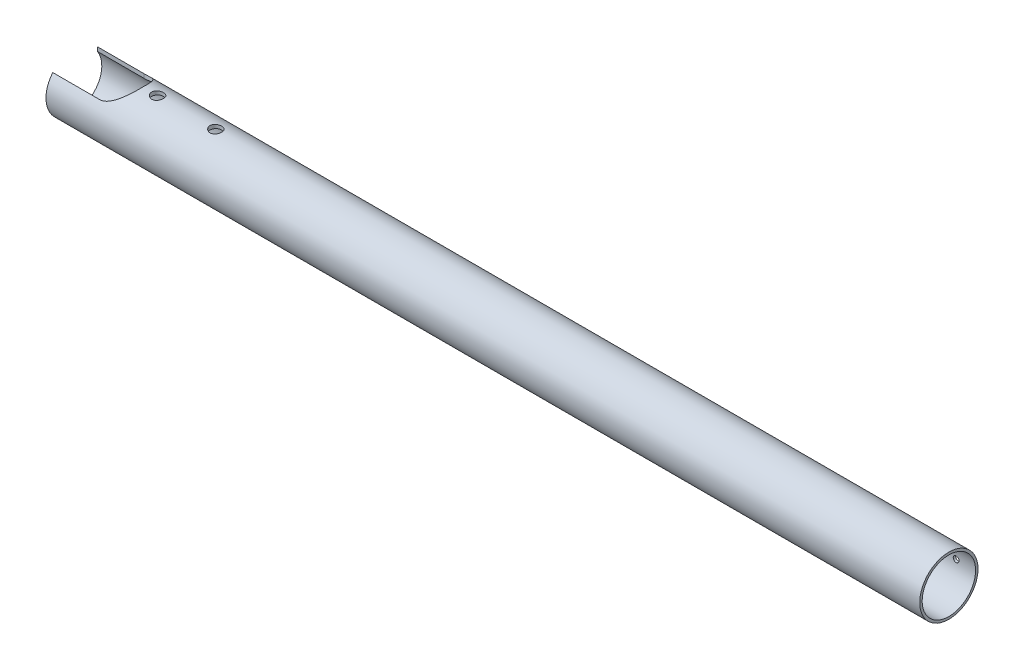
ISO-10303-21;
HEADER;
FILE_DESCRIPTION(('STEP AP214'),'2;1');
FILE_NAME('part.step','',(''),(''),'','','');
FILE_SCHEMA(('AUTOMOTIVE_DESIGN { 1 0 10303 214 1 1 1 1 }'));
ENDSEC;
DATA;
#1=APPLICATION_CONTEXT('core data for automotive mechanical design processes');
#2=APPLICATION_PROTOCOL_DEFINITION('international standard','automotive_design',2000,#1);
#3=PRODUCT_CONTEXT('',#1,'mechanical');
#4=PRODUCT('Part','Part','',(#3));
#5=PRODUCT_RELATED_PRODUCT_CATEGORY('part','',(#4));
#6=PRODUCT_DEFINITION_FORMATION('','',#4);
#7=PRODUCT_DEFINITION_CONTEXT('part definition',#1,'design');
#8=PRODUCT_DEFINITION('design','',#6,#7);
#9=PRODUCT_DEFINITION_SHAPE('','',#8);
#10=(LENGTH_UNIT() NAMED_UNIT(*) SI_UNIT(.MILLI.,.METRE.));
#11=(NAMED_UNIT(*) PLANE_ANGLE_UNIT() SI_UNIT($,.RADIAN.));
#12=(NAMED_UNIT(*) SI_UNIT($,.STERADIAN.) SOLID_ANGLE_UNIT());
#13=UNCERTAINTY_MEASURE_WITH_UNIT(LENGTH_MEASURE(1.E-05),#10,'distance_accuracy_value','');
#14=(GEOMETRIC_REPRESENTATION_CONTEXT(3) GLOBAL_UNCERTAINTY_ASSIGNED_CONTEXT((#13)) GLOBAL_UNIT_ASSIGNED_CONTEXT((#10,
#11,#12)) REPRESENTATION_CONTEXT('',''));
#15=CARTESIAN_POINT('',(0.,0.,0.));
#16=DIRECTION('',(0.,0.,1.));
#17=DIRECTION('',(1.,0.,0.));
#18=AXIS2_PLACEMENT_3D('',#15,#16,#17);
#19=CARTESIAN_POINT('',(900.,0.,0.));
#20=DIRECTION('',(-1.,0.,0.));
#21=DIRECTION('',(0.,0.,1.));
#22=AXIS2_PLACEMENT_3D('',#19,#20,#21);
#23=CYLINDRICAL_SURFACE('',#22,30.);
#24=CARTESIAN_POINT('',(883.,0.,-30.));
#25=CARTESIAN_POINT('',(882.999992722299,0.168061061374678,-29.9999980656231));
#26=CARTESIAN_POINT('',(882.985830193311,0.336233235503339,-29.9985727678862));
#27=CARTESIAN_POINT('',(882.929546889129,0.667915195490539,-29.9930240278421));
#28=CARTESIAN_POINT('',(882.887395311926,0.831419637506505,-29.9888976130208));
#29=CARTESIAN_POINT('',(882.776373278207,1.14891502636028,-29.9784124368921));
#30=CARTESIAN_POINT('',(882.707518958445,1.30291165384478,-29.9720550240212));
#31=CARTESIAN_POINT('',(882.545077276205,1.59712848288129,-29.9578187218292));
#32=CARTESIAN_POINT('',(882.451494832,1.73735141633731,-29.9499401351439));
#33=CARTESIAN_POINT('',(882.241891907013,2.00057865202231,-29.9335123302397));
#34=CARTESIAN_POINT('',(882.125800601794,2.12352643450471,-29.924961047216));
#35=CARTESIAN_POINT('',(881.874626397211,2.34822756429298,-29.9081687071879));
#36=CARTESIAN_POINT('',(881.739542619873,2.44997993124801,-29.8999276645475));
#37=CARTESIAN_POINT('',(881.453864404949,2.6296019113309,-29.8846677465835));
#38=CARTESIAN_POINT('',(881.303237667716,2.70742039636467,-29.8776515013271));
#39=CARTESIAN_POINT('',(880.990973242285,2.83663915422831,-29.8656611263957));
#40=CARTESIAN_POINT('',(880.829335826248,2.88804007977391,-29.8606869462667));
#41=CARTESIAN_POINT('',(880.500214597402,2.96279712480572,-29.8533625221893));
#42=CARTESIAN_POINT('',(880.332752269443,2.98624695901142,-29.8510035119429));
#43=CARTESIAN_POINT('',(879.996253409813,3.00472585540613,-29.8491492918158));
#44=CARTESIAN_POINT('',(879.827216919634,2.99975566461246,-29.8496540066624));
#45=CARTESIAN_POINT('',(879.49301407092,2.96161284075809,-29.853462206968));
#46=CARTESIAN_POINT('',(879.327835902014,2.92854253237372,-29.8567555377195));
#47=CARTESIAN_POINT('',(879.005386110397,2.83529743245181,-29.8657540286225));
#48=CARTESIAN_POINT('',(878.848114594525,2.77512227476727,-29.8714592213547));
#49=CARTESIAN_POINT('',(878.545619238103,2.62926268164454,-29.8846502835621));
#50=CARTESIAN_POINT('',(878.400417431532,2.54353284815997,-29.8921393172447));
#51=CARTESIAN_POINT('',(878.126424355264,2.34903008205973,-29.9080515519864));
#52=CARTESIAN_POINT('',(877.997633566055,2.24025647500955,-29.9164747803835));
#53=CARTESIAN_POINT('',(877.759523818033,2.00218233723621,-29.9333515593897));
#54=CARTESIAN_POINT('',(877.650293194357,1.87279343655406,-29.9418050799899));
#55=CARTESIAN_POINT('',(877.455089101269,1.59746844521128,-29.9577548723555));
#56=CARTESIAN_POINT('',(877.36911565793,1.45153233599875,-29.9652511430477));
#57=CARTESIAN_POINT('',(877.222869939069,1.14719431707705,-29.9784442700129));
#58=CARTESIAN_POINT('',(877.162602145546,0.988790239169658,-29.9841408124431));
#59=CARTESIAN_POINT('',(877.069543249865,0.664041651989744,-29.9930894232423));
#60=CARTESIAN_POINT('',(877.036751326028,0.497697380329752,-29.9963415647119));
#61=CARTESIAN_POINT('',(876.999687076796,0.162555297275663,-30.0000255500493));
#62=CARTESIAN_POINT('',(876.995292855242,-0.00622890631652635,-30.0004694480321));
#63=CARTESIAN_POINT('',(877.014828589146,-0.342131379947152,-29.9985192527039));
#64=CARTESIAN_POINT('',(877.038758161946,-0.509249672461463,-29.996125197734));
#65=CARTESIAN_POINT('',(877.114161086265,-0.836724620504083,-29.9887758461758));
#66=CARTESIAN_POINT('',(877.165577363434,-0.997094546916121,-29.9838258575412));
#67=CARTESIAN_POINT('',(877.294435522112,-1.30693296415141,-29.9719199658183));
#68=CARTESIAN_POINT('',(877.371877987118,-1.45640121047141,-29.9649640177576));
#69=CARTESIAN_POINT('',(877.550892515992,-1.7407445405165,-29.9497942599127));
#70=CARTESIAN_POINT('',(877.652544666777,-1.87556897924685,-29.9415763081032));
#71=CARTESIAN_POINT('',(877.876978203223,-2.12628486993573,-29.9248179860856));
#72=CARTESIAN_POINT('',(877.999760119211,-2.2421758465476,-29.9162776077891));
#73=CARTESIAN_POINT('',(878.263499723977,-2.45215832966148,-29.8998007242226));
#74=CARTESIAN_POINT('',(878.404521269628,-2.54616983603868,-29.8918665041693));
#75=CARTESIAN_POINT('',(878.70042208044,-2.70917477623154,-29.8775349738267));
#76=CARTESIAN_POINT('',(878.855301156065,-2.7781685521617,-29.8711376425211));
#77=CARTESIAN_POINT('',(879.174246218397,-2.88904562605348,-29.8606184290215));
#78=CARTESIAN_POINT('',(879.338295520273,-2.93097652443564,-29.8564925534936));
#79=CARTESIAN_POINT('',(879.671149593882,-2.98669202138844,-29.8509709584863));
#80=CARTESIAN_POINT('',(879.839954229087,-3.0004774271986,-29.8495751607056));
#81=CARTESIAN_POINT('',(880.17673206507,-2.99949941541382,-29.8496733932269));
#82=CARTESIAN_POINT('',(880.344705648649,-2.98486166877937,-29.8511547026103));
#83=CARTESIAN_POINT('',(880.675794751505,-2.92771635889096,-29.8568131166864));
#84=CARTESIAN_POINT('',(880.838910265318,-2.88520876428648,-29.8609902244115));
#85=CARTESIAN_POINT('',(881.155652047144,-2.77356505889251,-29.8715660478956));
#86=CARTESIAN_POINT('',(881.309279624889,-2.70443263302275,-29.8779644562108));
#87=CARTESIAN_POINT('',(881.602770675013,-2.54151466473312,-29.8922625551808));
#88=CARTESIAN_POINT('',(881.742634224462,-2.44772926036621,-29.9001622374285));
#89=CARTESIAN_POINT('',(882.005271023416,-2.23769566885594,-29.9166146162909));
#90=CARTESIAN_POINT('',(882.127969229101,-2.12135384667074,-29.9251699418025));
#91=CARTESIAN_POINT('',(882.352156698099,-1.86969509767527,-29.9419456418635));
#92=CARTESIAN_POINT('',(882.453640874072,-1.73437363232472,-29.9501659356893));
#93=CARTESIAN_POINT('',(882.632720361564,-1.44822430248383,-29.9653668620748));
#94=CARTESIAN_POINT('',(882.710254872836,-1.29735824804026,-29.9723443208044));
#95=CARTESIAN_POINT('',(882.838787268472,-0.984774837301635,-29.9842388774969));
#96=CARTESIAN_POINT('',(882.889815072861,-0.823069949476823,-29.9891582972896));
#97=CARTESIAN_POINT('',(882.951161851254,-0.550374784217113,-29.995146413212));
#98=CARTESIAN_POINT('',(882.969451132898,-0.441127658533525,-29.996958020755));
#99=CARTESIAN_POINT('',(882.993872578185,-0.221269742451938,-29.9993854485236));
#100=CARTESIAN_POINT('',(883.000004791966,-0.110658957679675,-30.0000012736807));
#101=CARTESIAN_POINT('',(883.,0.,-30.));
#102=B_SPLINE_CURVE_WITH_KNOTS('',3,(#24,#25,#26,#27,#28,#29,#30,#31,#32,#33,#34,#35,#36,#37,
#38,#39,#40,#41,#42,#43,#44,#45,#46,#47,#48,#49,#50,#51,#52,#53,#54,#55,#56,#57,#58,#59,#60,#61,
#62,#63,#64,#65,#66,#67,#68,#69,#70,#71,#72,#73,#74,#75,#76,#77,#78,#79,#80,#81,#82,#83,#84,#85,
#86,#87,#88,#89,#90,#91,#92,#93,#94,#95,#96,#97,#98,#99,#100,#101),.UNSPECIFIED.,.T.,.F.,(4,2,2,
2,2,2,2,2,2,2,2,2,2,2,2,2,2,2,2,2,2,2,2,2,2,2,2,2,2,2,2,2,2,2,2,2,2,2,4),(0.,0.503779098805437,
1.0081135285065,1.51214365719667,2.01607361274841,2.52161570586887,3.02718117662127,
3.53381926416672,4.04044483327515,4.5453669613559,5.05027581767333,5.55335392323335,
6.0564388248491,6.5604228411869,7.06442160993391,7.57064202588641,8.07686300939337,
8.58317222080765,9.08946629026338,9.59358565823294,10.0976982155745,10.6007680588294,
11.1038491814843,11.6086182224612,12.1133999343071,12.6199993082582,13.1265917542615,
13.6322907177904,14.1379751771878,14.6414288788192,15.1448831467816,15.6482677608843,
16.1516495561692,16.65716752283,17.1628065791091,17.6697189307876,18.1760578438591,
18.5077700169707,18.8394808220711),.UNSPECIFIED.);
#103=CARTESIAN_POINT('',(883.,0.,-30.));
#104=VERTEX_POINT('',#103);
#105=EDGE_CURVE('E125',#104,#104,#102,.T.);
#106=ORIENTED_EDGE('',*,*,#105,.T.);
#107=EDGE_LOOP('',(#106));
#108=FACE_BOUND('',#107,.T.);
#109=CARTESIAN_POINT('',(85.,29.3938769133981,-5.99999999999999));
#110=CARTESIAN_POINT('',(84.8332508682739,29.393875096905,-6.00000333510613));
#111=CARTESIAN_POINT('',(84.6665433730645,29.3952984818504,-5.99304686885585));
#112=CARTESIAN_POINT('',(84.3342836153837,29.4009458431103,-5.96528300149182));
#113=CARTESIAN_POINT('',(84.1687315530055,29.40517029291,-5.9444732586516));
#114=CARTESIAN_POINT('',(83.8399430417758,29.4163000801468,-5.88914931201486));
#115=CARTESIAN_POINT('',(83.6767078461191,29.4232068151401,-5.85462796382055));
#116=CARTESIAN_POINT('',(83.3537332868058,29.4395002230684,-5.77213943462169));
#117=CARTESIAN_POINT('',(83.1939952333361,29.4488878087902,-5.72416730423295));
#118=CARTESIAN_POINT('',(82.8794126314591,29.4698539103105,-5.61522748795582));
#119=CARTESIAN_POINT('',(82.7245616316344,29.4814293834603,-5.55427783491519));
#120=CARTESIAN_POINT('',(82.4205243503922,29.5064523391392,-5.41977382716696));
#121=CARTESIAN_POINT('',(82.2713401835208,29.5199005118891,-5.34621482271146));
#122=CARTESIAN_POINT('',(81.9797639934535,29.5482787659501,-5.18707511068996));
#123=CARTESIAN_POINT('',(81.8373689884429,29.5632081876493,-5.10149974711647));
#124=CARTESIAN_POINT('',(81.5601906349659,29.594143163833,-4.91886856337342));
#125=CARTESIAN_POINT('',(81.4254101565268,29.6101491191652,-4.82180845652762));
#126=CARTESIAN_POINT('',(81.1627928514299,29.6429919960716,-4.61563131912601));
#127=CARTESIAN_POINT('',(81.0350620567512,29.659836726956,-4.50638045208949));
#128=CARTESIAN_POINT('',(80.789178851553,29.6937060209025,-4.27752319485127));
#129=CARTESIAN_POINT('',(80.671030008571,29.7107306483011,-4.15791298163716));
#130=CARTESIAN_POINT('',(80.4451964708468,29.7444746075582,-3.90921587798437));
#131=CARTESIAN_POINT('',(80.33750869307,29.761194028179,-3.78013179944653));
#132=CARTESIAN_POINT('',(80.1332611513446,29.793874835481,-3.51327430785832));
#133=CARTESIAN_POINT('',(80.036705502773,29.8098359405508,-3.37549771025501));
#134=CARTESIAN_POINT('',(79.8546888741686,29.8406787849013,-3.09103878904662));
#135=CARTESIAN_POINT('',(79.7693275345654,29.8555503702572,-2.94429156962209));
#136=CARTESIAN_POINT('',(79.6112582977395,29.8836491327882,-2.64391411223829));
#137=CARTESIAN_POINT('',(79.5385551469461,29.8968756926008,-2.49028131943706));
#138=CARTESIAN_POINT('',(79.4064231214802,29.9212946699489,-2.17731919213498));
#139=CARTESIAN_POINT('',(79.346988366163,29.9324879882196,-2.01799241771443));
#140=CARTESIAN_POINT('',(79.2418008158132,29.9525329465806,-1.69472460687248));
#141=CARTESIAN_POINT('',(79.1960529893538,29.9613837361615,-1.53078191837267));
#142=CARTESIAN_POINT('',(79.0810227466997,29.9838019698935,-1.03829197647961));
#143=CARTESIAN_POINT('',(79.0320517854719,29.9935985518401,-0.704557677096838));
#144=CARTESIAN_POINT('',(78.9906766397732,30.001859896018,-0.0336601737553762));
#145=CARTESIAN_POINT('',(78.9982670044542,30.0003257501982,0.303502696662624));
#146=CARTESIAN_POINT('',(79.0691617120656,29.9862248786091,0.966838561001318));
#147=CARTESIAN_POINT('',(79.1316711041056,29.9738155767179,1.29309968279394));
#148=CARTESIAN_POINT('',(79.3093889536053,29.9395309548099,1.93039336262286));
#149=CARTESIAN_POINT('',(79.4245995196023,29.9176552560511,2.24142531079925));
#150=CARTESIAN_POINT('',(79.7051805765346,29.8666376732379,2.84171580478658));
#151=CARTESIAN_POINT('',(79.8708625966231,29.837450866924,3.13082478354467));
#152=CARTESIAN_POINT('',(80.2474543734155,29.7750281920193,3.67743053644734));
#153=CARTESIAN_POINT('',(80.4583693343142,29.7417918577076,3.9349236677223));
#154=CARTESIAN_POINT('',(80.9238017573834,29.6742578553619,4.41570851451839));
#155=CARTESIAN_POINT('',(81.1790151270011,29.6399517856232,4.63832588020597));
#156=CARTESIAN_POINT('',(81.7234986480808,29.5746942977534,5.03771097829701));
#157=CARTESIAN_POINT('',(82.0127694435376,29.5437429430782,5.21447784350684));
#158=CARTESIAN_POINT('',(82.6181249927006,29.488682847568,5.51737688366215));
#159=CARTESIAN_POINT('',(82.934265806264,29.4645888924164,5.64339988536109));
#160=CARTESIAN_POINT('',(83.583827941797,29.4261885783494,5.84034205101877));
#161=CARTESIAN_POINT('',(83.9172470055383,29.4118809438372,5.91126839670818));
#162=CARTESIAN_POINT('',(84.5857891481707,29.3949287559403,5.99499603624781));
#163=CARTESIAN_POINT('',(84.9207854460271,29.392088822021,6.00877115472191));
#164=CARTESIAN_POINT('',(85.5882893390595,29.3978691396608,5.98042576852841));
#165=CARTESIAN_POINT('',(85.9207970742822,29.4064887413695,5.93830843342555));
#166=CARTESIAN_POINT('',(86.570611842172,29.4340339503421,5.80021325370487));
#167=CARTESIAN_POINT('',(86.8880340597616,29.4528599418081,5.70475574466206));
#168=CARTESIAN_POINT('',(87.5023796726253,29.4986093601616,5.4632461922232));
#169=CARTESIAN_POINT('',(87.799301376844,29.52553345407,5.31718998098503));
#170=CARTESIAN_POINT('',(88.3684786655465,29.584884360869,4.9764249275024));
#171=CARTESIAN_POINT('',(88.6403622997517,29.6173783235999,4.78110674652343));
#172=CARTESIAN_POINT('',(89.1478498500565,29.6840234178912,4.34817315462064));
#173=CARTESIAN_POINT('',(89.3834500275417,29.7181747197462,4.11055339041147));
#174=CARTESIAN_POINT('',(89.8153754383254,29.7849207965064,3.59539469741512));
#175=CARTESIAN_POINT('',(90.0110422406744,29.8174836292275,3.31729896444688));
#176=CARTESIAN_POINT('',(90.3528749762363,29.8768274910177,2.73160340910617));
#177=CARTESIAN_POINT('',(90.499042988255,29.9036087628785,2.42400482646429));
#178=CARTESIAN_POINT('',(90.7367743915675,29.9482382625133,1.7898308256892));
#179=CARTESIAN_POINT('',(90.8286474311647,29.9661370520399,1.46337490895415));
#180=CARTESIAN_POINT('',(90.9561431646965,29.9911918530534,0.799081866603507));
#181=CARTESIAN_POINT('',(90.991772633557,29.9983491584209,0.461246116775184));
#182=CARTESIAN_POINT('',(91.0021604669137,30.0004347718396,-0.0431170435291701));
#183=CARTESIAN_POINT('',(90.9986507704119,29.999729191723,-0.209457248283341));
#184=CARTESIAN_POINT('',(90.9778462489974,29.9955746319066,-0.541221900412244));
#185=CARTESIAN_POINT('',(90.9605566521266,29.9921266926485,-0.706646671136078));
#186=CARTESIAN_POINT('',(90.9123143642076,29.982576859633,-1.03545948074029));
#187=CARTESIAN_POINT('',(90.8813569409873,29.9764740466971,-1.19884679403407));
#188=CARTESIAN_POINT('',(90.8060381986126,29.9617875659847,-1.52232847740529));
#189=CARTESIAN_POINT('',(90.7616816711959,29.9532047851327,-1.68242400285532));
#190=CARTESIAN_POINT('',(90.6599993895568,29.9338121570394,-1.99795666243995));
#191=CARTESIAN_POINT('',(90.6026989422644,29.9230066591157,-2.15340222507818));
#192=CARTESIAN_POINT('',(90.4755304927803,29.8994570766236,-2.45884588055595));
#193=CARTESIAN_POINT('',(90.4056669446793,29.8867136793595,-2.60884588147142));
#194=CARTESIAN_POINT('',(90.2538320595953,29.8596244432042,-2.90251338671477));
#195=CARTESIAN_POINT('',(90.1718557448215,29.8452779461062,-3.04617825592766));
#196=CARTESIAN_POINT('',(89.996422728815,29.8153781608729,-3.32611433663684));
#197=CARTESIAN_POINT('',(89.9029699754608,29.7998252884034,-3.46238806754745));
#198=CARTESIAN_POINT('',(89.7035646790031,29.7676616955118,-3.72889132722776));
#199=CARTESIAN_POINT('',(89.5974312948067,29.7510377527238,-3.85898398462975));
#200=CARTESIAN_POINT('',(89.3747063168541,29.717435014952,-4.10975159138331));
#201=CARTESIAN_POINT('',(89.258118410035,29.7004563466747,-4.23042983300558));
#202=CARTESIAN_POINT('',(89.01516703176,29.6665989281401,-4.4616785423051));
#203=CARTESIAN_POINT('',(88.8887977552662,29.649720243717,-4.5722429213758));
#204=CARTESIAN_POINT('',(88.6272412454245,29.6165504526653,-4.78239003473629));
#205=CARTESIAN_POINT('',(88.4920572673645,29.6002591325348,-4.88197678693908));
#206=CARTESIAN_POINT('',(88.2121777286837,29.5685397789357,-5.07057246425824));
#207=CARTESIAN_POINT('',(88.0673927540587,29.5531234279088,-5.15945073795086));
#208=CARTESIAN_POINT('',(87.7707464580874,29.5238083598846,-5.32463866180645));
#209=CARTESIAN_POINT('',(87.6188877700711,29.5099090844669,-5.40095294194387));
#210=CARTESIAN_POINT('',(87.3091946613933,29.4840397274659,-5.54043652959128));
#211=CARTESIAN_POINT('',(87.1513639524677,29.4720684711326,-5.60361384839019));
#212=CARTESIAN_POINT('',(86.8308232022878,29.4504044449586,-5.71637667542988));
#213=CARTESIAN_POINT('',(86.668114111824,29.440711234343,-5.76596481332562));
#214=CARTESIAN_POINT('',(86.258538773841,29.4197929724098,-5.87197100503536));
#215=CARTESIAN_POINT('',(86.0093464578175,29.4101281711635,-5.9199160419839));
#216=CARTESIAN_POINT('',(85.5067372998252,29.397171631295,-5.98392745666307));
#217=CARTESIAN_POINT('',(85.2533206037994,29.3938796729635,-5.99999493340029));
#218=CARTESIAN_POINT('',(85.,29.3938769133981,-5.99999999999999));
#219=B_SPLINE_CURVE_WITH_KNOTS('',3,(#109,#110,#111,#112,#113,#114,#115,#116,#117,#118,#119,
#120,#121,#122,#123,#124,#125,#126,#127,#128,#129,#130,#131,#132,#133,#134,#135,#136,#137,#138,
#139,#140,#141,#142,#143,#144,#145,#146,#147,#148,#149,#150,#151,#152,#153,#154,#155,#156,#157,
#158,#159,#160,#161,#162,#163,#164,#165,#166,#167,#168,#169,#170,#171,#172,#173,#174,#175,#176,
#177,#178,#179,#180,#181,#182,#183,#184,#185,#186,#187,#188,#189,#190,#191,#192,#193,#194,#195,
#196,#197,#198,#199,#200,#201,#202,#203,#204,#205,#206,#207,#208,#209,#210,#211,#212,#213,#214,
#215,#216,#217,#218),.UNSPECIFIED.,.T.,.F.,(4,2,2,2,2,2,2,2,2,2,2,2,2,2,2,2,2,2,2,2,2,2,2,2,2,2,
2,2,2,2,2,2,2,2,2,2,2,2,2,2,2,2,2,2,2,2,2,2,2,2,2,2,2,2,4),(0.,0.500024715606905,
1.00013397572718,1.50050415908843,2.00105870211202,2.50092218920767,3.0009704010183,
3.50079692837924,4.00081060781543,4.50698586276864,5.01334871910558,5.51956188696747,
6.02596159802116,6.53660041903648,7.04743030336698,7.55803333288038,8.06882149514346,
9.07582433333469,10.0827301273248,11.0752967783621,12.0679031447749,13.0667648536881,
14.0657415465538,15.0821302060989,16.0985380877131,17.1171211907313,18.1355715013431,
19.1365948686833,20.1375614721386,21.1289299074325,22.1203800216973,23.1247529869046,
24.1292293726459,25.1491255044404,26.1689787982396,27.1829582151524,28.196815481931,
28.6954646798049,29.1939247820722,29.692557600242,30.1910123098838,30.6885007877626,
31.185813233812,31.683330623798,32.1806773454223,32.6862322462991,33.1916095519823,
33.697289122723,34.2027829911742,34.7139260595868,35.2248803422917,35.7355221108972,
36.2460649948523,37.0057147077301,37.7653382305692),.UNSPECIFIED.);
#220=CARTESIAN_POINT('',(85.,29.3938769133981,-5.99999999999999));
#221=VERTEX_POINT('',#220);
#222=EDGE_CURVE('E111',#221,#221,#219,.T.);
#223=ORIENTED_EDGE('',*,*,#222,.F.);
#224=EDGE_LOOP('',(#223));
#225=FACE_BOUND('',#224,.T.);
#226=CARTESIAN_POINT('',(900.,0.,0.));
#227=DIRECTION('',(1.,0.,0.));
#228=DIRECTION('',(0.,0.,-1.));
#229=AXIS2_PLACEMENT_3D('',#226,#227,#228);
#230=CIRCLE('',#229,30.);
#231=CARTESIAN_POINT('',(900.,0.,-30.));
#232=VERTEX_POINT('',#231);
#233=EDGE_CURVE('E244',#232,#232,#230,.T.);
#234=ORIENTED_EDGE('',*,*,#233,.F.);
#235=EDGE_LOOP('',(#234));
#236=FACE_BOUND('',#235,.T.);
#237=DIRECTION('',(-1.,0.,0.));
#238=VECTOR('',#237,1.);
#239=CARTESIAN_POINT('',(900.,19.2613602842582,23.));
#240=LINE('',#239,#238);
#241=CARTESIAN_POINT('',(0.,19.2613602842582,23.));
#242=VERTEX_POINT('',#241);
#243=CARTESIAN_POINT('',(47.9999999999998,19.2613602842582,23.));
#244=VERTEX_POINT('',#243);
#245=EDGE_CURVE('E234',#242,#244,#240,.F.);
#246=ORIENTED_EDGE('',*,*,#245,.F.);
#247=CARTESIAN_POINT('',(0.,0.,0.));
#248=DIRECTION('',(1.,0.,0.));
#249=DIRECTION('',(0.,0.,-1.));
#250=AXIS2_PLACEMENT_3D('',#247,#248,#249);
#251=CIRCLE('',#250,30.);
#252=CARTESIAN_POINT('',(0.,19.2613602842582,-23.));
#253=VERTEX_POINT('',#252);
#254=EDGE_CURVE('E240',#242,#253,#251,.T.);
#255=ORIENTED_EDGE('',*,*,#254,.T.);
#256=DIRECTION('',(-1.,0.,0.));
#257=VECTOR('',#256,1.);
#258=CARTESIAN_POINT('',(900.,19.2613602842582,-23.));
#259=LINE('',#258,#257);
#260=CARTESIAN_POINT('',(47.9999999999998,19.2613602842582,-23.));
#261=VERTEX_POINT('',#260);
#262=EDGE_CURVE('E175',#261,#253,#259,.T.);
#263=ORIENTED_EDGE('',*,*,#262,.F.);
#264=CARTESIAN_POINT('',(48.,19.2613602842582,-23.));
#265=CARTESIAN_POINT('',(47.7467315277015,19.2613601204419,-23.0000000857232));
#266=CARTESIAN_POINT('',(47.4934644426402,19.2665921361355,-22.9956222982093));
#267=CARTESIAN_POINT('',(46.9876583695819,19.2874203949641,-22.9781541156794));
#268=CARTESIAN_POINT('',(46.7351194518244,19.3030176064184,-22.9650629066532));
#269=CARTESIAN_POINT('',(45.9794470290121,19.3650578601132,-22.9128285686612));
#270=CARTESIAN_POINT('',(45.4783311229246,19.4267494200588,-22.8607247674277));
#271=CARTESIAN_POINT('',(44.4853881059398,19.5873603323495,-22.7232553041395));
#272=CARTESIAN_POINT('',(43.9935941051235,19.6863930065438,-22.6377883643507));
#273=CARTESIAN_POINT('',(43.0239735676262,19.916518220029,-22.4355898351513));
#274=CARTESIAN_POINT('',(42.54615306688,20.0476243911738,-22.3188449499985));
#275=CARTESIAN_POINT('',(41.7929039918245,20.279016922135,-22.1082638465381));
#276=CARTESIAN_POINT('',(41.5122314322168,20.3709594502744,-22.0236527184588));
#277=CARTESIAN_POINT('',(40.9571967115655,20.5631907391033,-21.8442780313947));
#278=CARTESIAN_POINT('',(40.6828321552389,20.6634762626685,-21.7495184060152));
#279=CARTESIAN_POINT('',(39.8690868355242,20.9752096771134,-21.4504865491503));
#280=CARTESIAN_POINT('',(39.3391812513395,21.1974944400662,-21.2314971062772));
#281=CARTESIAN_POINT('',(38.3050569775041,21.6625183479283,-20.7568263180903));
#282=CARTESIAN_POINT('',(37.8008607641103,21.9052749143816,-20.5011135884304));
#283=CARTESIAN_POINT('',(36.8185653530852,22.4039179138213,-19.9549790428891));
#284=CARTESIAN_POINT('',(36.3404637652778,22.6598031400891,-19.664560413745));
#285=CARTESIAN_POINT('',(35.3988715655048,23.1850532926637,-19.0426642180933));
#286=CARTESIAN_POINT('',(34.9360335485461,23.4545950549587,-18.7103496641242));
#287=CARTESIAN_POINT('',(34.0381097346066,23.9954813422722,-18.0114456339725));
#288=CARTESIAN_POINT('',(33.6030247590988,24.2668259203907,-17.6448551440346));
#289=CARTESIAN_POINT('',(32.7617101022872,24.8061462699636,-16.8782298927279));
#290=CARTESIAN_POINT('',(32.3554633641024,25.0741239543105,-16.4782152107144));
#291=CARTESIAN_POINT('',(31.5729262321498,25.6022520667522,-15.6450616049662));
#292=CARTESIAN_POINT('',(31.1966348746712,25.8624027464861,-15.2119237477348));
#293=CARTESIAN_POINT('',(30.4797776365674,26.3677546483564,-14.3179033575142));
#294=CARTESIAN_POINT('',(30.1388731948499,26.6130858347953,-13.8573664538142));
#295=CARTESIAN_POINT('',(29.4906395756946,27.0875830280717,-12.9052597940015));
#296=CARTESIAN_POINT('',(29.1833114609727,27.3167485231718,-12.4136890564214));
#297=CARTESIAN_POINT('',(28.605282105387,27.7545880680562,-11.4011778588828));
#298=CARTESIAN_POINT('',(28.3345577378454,27.9632750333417,-10.8802562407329));
#299=CARTESIAN_POINT('',(27.8327407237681,28.3561696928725,-9.81080815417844));
#300=CARTESIAN_POINT('',(27.6016411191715,28.5403816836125,-9.26228655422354));
#301=CARTESIAN_POINT('',(27.214791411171,28.8541141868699,-8.22713853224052));
#302=CARTESIAN_POINT('',(27.0529169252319,28.9876877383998,-7.7440234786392));
#303=CARTESIAN_POINT('',(26.761916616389,29.2322607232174,-6.76244408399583));
#304=CARTESIAN_POINT('',(26.6327876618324,29.3432623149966,-6.26398121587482));
#305=CARTESIAN_POINT('',(26.4091794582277,29.5406694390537,-5.25481131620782));
#306=CARTESIAN_POINT('',(26.3146824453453,29.6270875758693,-4.74411070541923));
#307=CARTESIAN_POINT('',(26.1617835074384,29.7738146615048,-3.71359663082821));
#308=CARTESIAN_POINT('',(26.1033819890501,29.8341233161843,-3.19378306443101));
#309=CARTESIAN_POINT('',(26.0236438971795,29.9276867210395,-2.14719659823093));
#310=CARTESIAN_POINT('',(26.0024265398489,29.9608542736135,-1.62040675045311));
#311=CARTESIAN_POINT('',(25.9979668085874,29.9993090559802,-0.565642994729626));
#312=CARTESIAN_POINT('',(26.0147245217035,30.004596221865,-0.0376690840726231));
#313=CARTESIAN_POINT('',(26.0861440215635,29.9874386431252,1.01529521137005));
#314=CARTESIAN_POINT('',(26.1408094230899,29.964991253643,1.5402853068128));
#315=CARTESIAN_POINT('',(26.2873700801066,29.8931517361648,2.5831498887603));
#316=CARTESIAN_POINT('',(26.3792646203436,29.8437601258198,3.10102451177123));
#317=CARTESIAN_POINT('',(26.5936995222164,29.722449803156,4.10086843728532));
#318=CARTESIAN_POINT('',(26.7145246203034,29.651748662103,4.583356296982));
#319=CARTESIAN_POINT('',(26.9873725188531,29.4888090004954,5.53565745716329));
#320=CARTESIAN_POINT('',(27.1393940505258,29.396571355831,6.005471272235));
#321=CARTESIAN_POINT('',(27.4730531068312,29.1924353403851,6.93007256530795));
#322=CARTESIAN_POINT('',(27.6546929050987,29.0805354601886,7.38485888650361));
#323=CARTESIAN_POINT('',(28.0458842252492,28.8391731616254,8.27743191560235));
#324=CARTESIAN_POINT('',(28.2554373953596,28.7097097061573,8.7152176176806));
#325=CARTESIAN_POINT('',(28.7216108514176,28.4226006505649,9.61238139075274));
#326=CARTESIAN_POINT('',(28.980801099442,28.2634512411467,10.0699422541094));
#327=CARTESIAN_POINT('',(29.5284009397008,27.9298318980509,10.9613423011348));
#328=CARTESIAN_POINT('',(29.8168120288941,27.7553611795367,11.395180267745));
#329=CARTESIAN_POINT('',(30.4211190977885,27.3940669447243,12.2382828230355));
#330=CARTESIAN_POINT('',(30.737032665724,27.2072355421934,12.6475313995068));
#331=CARTESIAN_POINT('',(31.3945332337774,26.8244436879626,13.440351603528));
#332=CARTESIAN_POINT('',(31.7361231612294,26.6284821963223,13.8239202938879));
#333=CARTESIAN_POINT('',(32.5076748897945,26.1945856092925,14.6318222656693));
#334=CARTESIAN_POINT('',(32.9424359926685,25.955477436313,15.0509534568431));
#335=CARTESIAN_POINT('',(33.844061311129,25.4744607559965,15.8514972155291));
#336=CARTESIAN_POINT('',(34.3109310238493,25.2325517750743,16.2329032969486));
#337=CARTESIAN_POINT('',(35.2756327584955,24.7517386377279,16.9570155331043));
#338=CARTESIAN_POINT('',(35.7734787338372,24.5128358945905,17.2997040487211));
#339=CARTESIAN_POINT('',(36.7989097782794,24.0446627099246,17.944718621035));
#340=CARTESIAN_POINT('',(37.326489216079,23.8153904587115,18.2470522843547));
#341=CARTESIAN_POINT('',(38.3221616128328,23.4097464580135,18.7636192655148));
#342=CARTESIAN_POINT('',(38.7859430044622,23.2308416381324,18.9841811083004));
#343=CARTESIAN_POINT('',(39.7330427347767,22.8896463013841,19.3942059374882));
#344=CARTESIAN_POINT('',(40.2163605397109,22.7273553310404,19.5836697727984));
#345=CARTESIAN_POINT('',(41.2004834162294,22.4248379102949,19.9293590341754));
#346=CARTESIAN_POINT('',(41.7012560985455,22.2845730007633,20.0856425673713));
#347=CARTESIAN_POINT('',(42.7191107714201,22.0311538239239,20.3632925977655));
#348=CARTESIAN_POINT('',(43.2361893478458,21.9179939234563,20.4846663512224));
#349=CARTESIAN_POINT('',(44.1978588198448,21.7397813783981,20.6735551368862));
#350=CARTESIAN_POINT('',(44.6404619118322,21.6698862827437,20.7466339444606));
#351=CARTESIAN_POINT('',(45.5325062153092,21.55515386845,20.8658149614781));
#352=CARTESIAN_POINT('',(45.9819466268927,21.5103136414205,20.911920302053));
#353=CARTESIAN_POINT('',(46.8843770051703,21.4474912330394,20.9763477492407));
#354=CARTESIAN_POINT('',(47.3373641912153,21.4294897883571,20.994689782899));
#355=CARTESIAN_POINT('',(48.2438784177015,21.4210339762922,21.0033174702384));
#356=CARTESIAN_POINT('',(48.6974054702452,21.4305802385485,20.9936024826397));
#357=CARTESIAN_POINT('',(49.6010328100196,21.476791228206,20.9463244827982));
#358=CARTESIAN_POINT('',(50.051136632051,21.5134225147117,20.9087958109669));
#359=CARTESIAN_POINT('',(50.94536899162,21.6122845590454,20.8065897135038));
#360=CARTESIAN_POINT('',(51.3894975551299,21.6745152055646,20.7419124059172));
#361=CARTESIAN_POINT('',(52.2696990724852,21.8223383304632,20.5863313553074));
#362=CARTESIAN_POINT('',(52.7057616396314,21.9079589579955,20.4953960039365));
#363=CARTESIAN_POINT('',(53.5674023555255,22.0996937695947,20.2885040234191));
#364=CARTESIAN_POINT('',(53.9929778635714,22.2058130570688,20.1725411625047));
#365=CARTESIAN_POINT('',(54.69964063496,22.3991804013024,19.9572173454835));
#366=CARTESIAN_POINT('',(54.9839492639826,22.481818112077,19.8641627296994));
#367=CARTESIAN_POINT('',(55.5465402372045,22.6542106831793,19.667329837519));
#368=CARTESIAN_POINT('',(55.8248239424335,22.7439639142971,19.563554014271));
#369=CARTESIAN_POINT('',(56.6505794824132,23.022531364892,19.2365534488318));
#370=CARTESIAN_POINT('',(57.1888301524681,23.2206181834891,18.9976941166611));
#371=CARTESIAN_POINT('',(58.2398600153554,23.6343355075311,18.4804770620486));
#372=CARTESIAN_POINT('',(58.7525998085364,23.8499918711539,18.2020606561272));
#373=CARTESIAN_POINT('',(59.7509816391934,24.2919938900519,17.6078430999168));
#374=CARTESIAN_POINT('',(60.2366261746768,24.5183385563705,17.2920454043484));
#375=CARTESIAN_POINT('',(61.1914019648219,24.9813407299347,16.6163878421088));
#376=CARTESIAN_POINT('',(61.659855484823,25.2181153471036,16.2556511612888));
#377=CARTESIAN_POINT('',(62.5664581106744,25.6909937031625,15.4975001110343));
#378=CARTESIAN_POINT('',(63.0046057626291,25.9270974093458,15.1000839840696));
#379=CARTESIAN_POINT('',(63.8487617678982,26.3931647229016,14.2698014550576));
#380=CARTESIAN_POINT('',(64.2547971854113,26.6231333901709,13.8369655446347));
#381=CARTESIAN_POINT('',(64.8383915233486,26.9597826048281,13.1618166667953));
#382=CARTESIAN_POINT('',(65.0286785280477,27.0706142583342,12.9324529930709));
#383=CARTESIAN_POINT('',(65.4005549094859,27.2889522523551,12.4651360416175));
#384=CARTESIAN_POINT('',(65.5821420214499,27.3964577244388,12.2271805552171));
#385=CARTESIAN_POINT('',(66.08537859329,27.6963914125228,11.5389163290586));
#386=CARTESIAN_POINT('',(66.3962070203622,27.8840984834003,11.0785248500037));
#387=CARTESIAN_POINT('',(66.984681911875,28.2422575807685,10.1307220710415));
#388=CARTESIAN_POINT('',(67.2623334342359,28.4127122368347,9.6433149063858));
#389=CARTESIAN_POINT('',(67.7819247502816,28.7327204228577,8.64327925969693));
#390=CARTESIAN_POINT('',(68.023870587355,28.8822774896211,8.13065506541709));
#391=CARTESIAN_POINT('',(68.4693767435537,29.1569867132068,7.08262238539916));
#392=CARTESIAN_POINT('',(68.6729372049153,29.282138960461,6.54721398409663));
#393=CARTESIAN_POINT('',(69.0403997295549,29.5056329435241,5.4526981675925));
#394=CARTESIAN_POINT('',(69.203985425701,29.6037615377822,4.89344040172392));
#395=CARTESIAN_POINT('',(69.4869823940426,29.7690417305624,3.75931823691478));
#396=CARTESIAN_POINT('',(69.6063932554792,29.8361930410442,3.18445369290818));
#397=CARTESIAN_POINT('',(69.7990256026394,29.9372656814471,2.02454165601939));
#398=CARTESIAN_POINT('',(69.8722793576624,29.9712102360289,1.43950157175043));
#399=CARTESIAN_POINT('',(69.9715404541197,30.0045886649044,0.264477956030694));
#400=CARTESIAN_POINT('',(69.9975539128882,30.0040270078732,-0.325504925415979));
#401=CARTESIAN_POINT('',(70.0018229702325,29.970381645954,-1.42836136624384));
#402=CARTESIAN_POINT('',(69.9858114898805,29.9415066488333,-1.94135487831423));
#403=CARTESIAN_POINT('',(69.9182411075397,29.8577339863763,-2.96280860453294));
#404=CARTESIAN_POINT('',(69.8666858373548,29.8028389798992,-3.47126927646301));
#405=CARTESIAN_POINT('',(69.7289687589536,29.6679571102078,-4.48010874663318));
#406=CARTESIAN_POINT('',(69.6428048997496,29.5879687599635,-4.98048706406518));
#407=CARTESIAN_POINT('',(69.4372380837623,29.40430573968,-5.9699261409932));
#408=CARTESIAN_POINT('',(69.3178338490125,29.3006301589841,-6.4589864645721));
#409=CARTESIAN_POINT('',(69.0477438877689,29.0716083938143,-7.42199935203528));
#410=CARTESIAN_POINT('',(68.897123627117,28.9463076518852,-7.89598117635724));
#411=CARTESIAN_POINT('',(68.5662941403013,28.6759149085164,-8.82763886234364));
#412=CARTESIAN_POINT('',(68.3860853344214,28.5308231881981,-9.28531495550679));
#413=CARTESIAN_POINT('',(67.9979699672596,28.2230335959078,-10.1826007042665));
#414=CARTESIAN_POINT('',(67.7900635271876,28.0603358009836,-10.6222104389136));
#415=CARTESIAN_POINT('',(67.3483776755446,27.7195927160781,-11.4820781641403));
#416=CARTESIAN_POINT('',(67.114594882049,27.5415454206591,-11.9023336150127));
#417=CARTESIAN_POINT('',(66.5868356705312,27.1453586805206,-12.7826183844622));
#418=CARTESIAN_POINT('',(66.2890591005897,26.9251680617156,-13.2394478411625));
#419=CARTESIAN_POINT('',(65.6640735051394,26.4711671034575,-14.1253359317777));
#420=CARTESIAN_POINT('',(65.3368619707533,26.2373556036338,-14.5543921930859));
#421=CARTESIAN_POINT('',(64.6544803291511,25.7593297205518,-15.3846244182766));
#422=CARTESIAN_POINT('',(64.2992729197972,25.5151016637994,-15.7857617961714));
#423=CARTESIAN_POINT('',(63.5628136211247,25.0201664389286,-16.559047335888));
#424=CARTESIAN_POINT('',(63.1815607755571,24.7694590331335,-16.9311944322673));
#425=CARTESIAN_POINT('',(62.3142254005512,24.2141944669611,-17.7186180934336));
#426=CARTESIAN_POINT('',(61.8225621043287,23.9090262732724,-18.12733876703));
#427=CARTESIAN_POINT('',(60.8041498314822,23.3018465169,-18.9014809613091));
#428=CARTESIAN_POINT('',(60.2773904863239,22.9998359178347,-19.2668895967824));
#429=CARTESIAN_POINT('',(59.1896378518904,22.4074654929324,-19.9527098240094));
#430=CARTESIAN_POINT('',(58.6286655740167,22.1170986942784,-20.273148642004));
#431=CARTESIAN_POINT('',(57.4723547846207,21.5577286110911,-20.8669711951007));
#432=CARTESIAN_POINT('',(56.877035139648,21.2887137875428,-21.1403804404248));
#433=CARTESIAN_POINT('',(55.8598571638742,20.8695030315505,-21.5526980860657));
#434=CARTESIAN_POINT('',(55.4475729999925,20.7099326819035,-21.7057900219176));
#435=CARTESIAN_POINT('',(54.608418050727,20.4093206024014,-21.9886834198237));
#436=CARTESIAN_POINT('',(54.1815476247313,20.2682784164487,-22.1184854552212));
#437=CARTESIAN_POINT('',(53.3153634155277,20.009423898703,-22.3529289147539));
#438=CARTESIAN_POINT('',(52.8760876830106,19.8915478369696,-22.4576395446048));
#439=CARTESIAN_POINT('',(51.985904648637,19.6829595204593,-22.6406793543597));
#440=CARTESIAN_POINT('',(51.5350025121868,19.5922354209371,-22.719020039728));
#441=CARTESIAN_POINT('',(50.5739778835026,19.4336770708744,-22.8548576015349));
#442=CARTESIAN_POINT('',(50.0627764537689,19.369436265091,-22.9091334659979));
#443=CARTESIAN_POINT('',(49.2916372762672,19.3047979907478,-22.9635673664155));
#444=CARTESIAN_POINT('',(49.0338362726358,19.2885390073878,-22.9772153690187));
#445=CARTESIAN_POINT('',(48.51735651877,19.2668186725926,-22.9954329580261));
#446=CARTESIAN_POINT('',(48.2586775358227,19.2613604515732,-22.999999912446));
#447=CARTESIAN_POINT('',(48.,19.2613602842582,-23.));
#448=B_SPLINE_CURVE_WITH_KNOTS('',3,(#264,#265,#266,#267,#268,#269,#270,#271,#272,#273,#274,
#275,#276,#277,#278,#279,#280,#281,#282,#283,#284,#285,#286,#287,#288,#289,#290,#291,#292,#293,
#294,#295,#296,#297,#298,#299,#300,#301,#302,#303,#304,#305,#306,#307,#308,#309,#310,#311,#312,
#313,#314,#315,#316,#317,#318,#319,#320,#321,#322,#323,#324,#325,#326,#327,#328,#329,#330,#331,
#332,#333,#334,#335,#336,#337,#338,#339,#340,#341,#342,#343,#344,#345,#346,#347,#348,#349,#350,
#351,#352,#353,#354,#355,#356,#357,#358,#359,#360,#361,#362,#363,#364,#365,#366,#367,#368,#369,
#370,#371,#372,#373,#374,#375,#376,#377,#378,#379,#380,#381,#382,#383,#384,#385,#386,#387,#388,
#389,#390,#391,#392,#393,#394,#395,#396,#397,#398,#399,#400,#401,#402,#403,#404,#405,#406,#407,
#408,#409,#410,#411,#412,#413,#414,#415,#416,#417,#418,#419,#420,#421,#422,#423,#424,#425,#426,
#427,#428,#429,#430,#431,#432,#433,#434,#435,#436,#437,#438,#439,#440,#441,#442,#443,#444,#445,
#446,#447),.UNSPECIFIED.,.T.,.F.,(4,2,2,2,2,2,2,2,2,2,2,2,2,2,2,2,2,2,2,2,2,2,2,2,2,2,2,2,2,2,2,
2,2,2,2,2,2,2,2,2,2,2,2,2,2,2,2,2,2,2,2,2,2,2,2,2,2,2,2,2,2,2,2,2,2,2,2,2,2,2,2,2,2,2,2,2,2,2,2,
2,2,2,2,2,2,2,2,2,2,2,2,4),(0.,0.759701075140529,1.51947313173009,3.03923592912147,
4.56364847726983,6.08871005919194,7.01007849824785,7.9310910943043,9.77352783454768,
11.617548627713,13.4614002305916,15.3507958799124,17.2402474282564,19.1285719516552,
21.016835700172,22.8849373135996,24.7530980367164,26.6200728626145,28.4867195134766,
30.0653022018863,31.6437338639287,33.2213547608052,34.7989934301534,36.381680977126,
37.9643721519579,39.5472142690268,41.1300259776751,42.6355602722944,44.1410333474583,
45.6466220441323,47.1522996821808,48.7989793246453,50.4457433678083,52.0935683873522,
53.7415815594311,55.6881267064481,57.6350059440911,59.5827686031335,61.5301636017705,
63.1602958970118,64.7903836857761,66.4175927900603,68.0444634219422,69.4050569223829,
70.7654924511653,72.1249510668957,73.4844407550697,74.8422547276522,76.2000627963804,
77.5595122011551,78.9193004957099,79.8500450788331,80.7805771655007,82.6420478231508,
84.5063094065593,86.3703988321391,88.279305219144,90.1883031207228,92.0956745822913,
93.0493462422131,94.0032648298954,95.760468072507,97.5174030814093,99.2740403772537,
101.030671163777,102.800784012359,104.570913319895,106.339803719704,108.108465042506,
109.648751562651,111.188880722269,112.729101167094,114.269380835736,115.806462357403,
117.34352204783,118.880575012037,120.417829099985,122.180421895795,123.943165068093,
125.708297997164,127.473495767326,129.596625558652,131.720385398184,133.842853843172,
135.96416734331,137.366698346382,138.769194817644,140.167777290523,141.565748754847,
143.116771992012,143.892473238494,144.668399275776),.UNSPECIFIED.);
#449=CARTESIAN_POINT('',(70.,29.9833287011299,-0.999999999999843));
#450=VERTEX_POINT('',#449);
#451=EDGE_CURVE('E177',#450,#261,#448,.T.);
#452=ORIENTED_EDGE('',*,*,#451,.F.);
#453=CARTESIAN_POINT('',(70.,0.,0.));
#454=DIRECTION('',(-1.,0.,0.));
#455=DIRECTION('',(0.,0.,1.));
#456=AXIS2_PLACEMENT_3D('',#453,#454,#455);
#457=CIRCLE('',#456,30.);
#458=CARTESIAN_POINT('',(70.,29.9833287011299,0.999999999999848));
#459=VERTEX_POINT('',#458);
#460=EDGE_CURVE('E182',#459,#450,#457,.T.);
#461=ORIENTED_EDGE('',*,*,#460,.F.);
#462=CARTESIAN_POINT('',(48.,21.4242852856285,-21.));
#463=CARTESIAN_POINT('',(47.4708680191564,21.424293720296,-20.9999955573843));
#464=CARTESIAN_POINT('',(46.9416724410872,21.4430921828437,-20.9808656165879));
#465=CARTESIAN_POINT('',(45.8883596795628,21.5172539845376,-20.904796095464));
#466=CARTESIAN_POINT('',(45.3642456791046,21.5726389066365,-20.8478341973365));
#467=CARTESIAN_POINT('',(44.3247263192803,21.7171895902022,-20.6972106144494));
#468=CARTESIAN_POINT('',(43.8093468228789,21.8064418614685,-20.6034549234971));
#469=CARTESIAN_POINT('',(42.7923764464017,22.0143961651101,-20.3811050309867));
#470=CARTESIAN_POINT('',(42.2907845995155,22.1330961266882,-20.2525132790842));
#471=CARTESIAN_POINT('',(41.3097133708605,22.3934638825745,-19.9642178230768));
#472=CARTESIAN_POINT('',(40.8300423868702,22.5348428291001,-19.8049008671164));
#473=CARTESIAN_POINT('',(39.888023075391,22.8367468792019,-19.4560065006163));
#474=CARTESIAN_POINT('',(39.4256779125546,22.9972754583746,-19.2664235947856));
#475=CARTESIAN_POINT('',(38.5194799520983,23.3328192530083,-18.8586642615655));
#476=CARTESIAN_POINT('',(38.0756211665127,23.5078297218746,-18.6404971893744));
#477=CARTESIAN_POINT('',(37.2068155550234,23.8681833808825,-18.1768001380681));
#478=CARTESIAN_POINT('',(36.7818699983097,24.0535272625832,-17.9312683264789));
#479=CARTESIAN_POINT('',(35.8774135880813,24.4643132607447,-17.3677738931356));
#480=CARTESIAN_POINT('',(35.401655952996,24.6910199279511,-17.0446983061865));
#481=CARTESIAN_POINT('',(34.4778693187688,25.1478291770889,-16.3632217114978));
#482=CARTESIAN_POINT('',(34.0298424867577,25.3779320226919,-16.0048179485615));
#483=CARTESIAN_POINT('',(33.1620893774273,25.8366833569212,-15.2531917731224));
#484=CARTESIAN_POINT('',(32.7423977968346,26.0653297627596,-14.8599279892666));
#485=CARTESIAN_POINT('',(31.9333782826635,26.5160918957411,-14.0397968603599));
#486=CARTESIAN_POINT('',(31.5440523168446,26.738207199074,-13.612927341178));
#487=CARTESIAN_POINT('',(30.7400634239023,27.2047485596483,-12.65803141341));
#488=CARTESIAN_POINT('',(30.3307581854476,27.4473299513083,-12.1245589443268));
#489=CARTESIAN_POINT('',(29.5588338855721,27.9108045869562,-11.0158157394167));
#490=CARTESIAN_POINT('',(29.1962232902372,28.1316938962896,-10.4405374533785));
#491=CARTESIAN_POINT('',(28.5227138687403,28.5446624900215,-9.25186284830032));
#492=CARTESIAN_POINT('',(28.2117226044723,28.7367932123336,-8.63853742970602));
#493=CARTESIAN_POINT('',(27.7872909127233,28.9987416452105,-7.69286347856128));
#494=CARTESIAN_POINT('',(27.6528357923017,29.081675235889,-7.37339567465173));
#495=CARTESIAN_POINT('',(27.3984389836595,29.2381077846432,-6.72635284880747));
#496=CARTESIAN_POINT('',(27.2785008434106,29.3116044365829,-6.39877586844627));
#497=CARTESIAN_POINT('',(27.004370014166,29.4784892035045,-5.59067459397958));
#498=CARTESIAN_POINT('',(26.8582993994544,29.5664169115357,-5.10622314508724));
#499=CARTESIAN_POINT('',(26.5992800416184,29.7191868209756,-4.12509258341));
#500=CARTESIAN_POINT('',(26.4863241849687,29.7840339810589,-3.62841612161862));
#501=CARTESIAN_POINT('',(26.2949097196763,29.8890764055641,-2.62617395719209));
#502=CARTESIAN_POINT('',(26.2164301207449,29.9292866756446,-2.12061385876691));
#503=CARTESIAN_POINT('',(26.0948411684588,29.9840078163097,-1.10384626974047));
#504=CARTESIAN_POINT('',(26.0517331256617,29.9985177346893,-0.592638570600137));
#505=CARTESIAN_POINT('',(26.0013292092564,30.0012682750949,0.432390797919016));
#506=CARTESIAN_POINT('',(25.9940875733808,29.9894691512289,0.946215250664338));
#507=CARTESIAN_POINT('',(26.0154906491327,29.9395310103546,1.97182169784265));
#508=CARTESIAN_POINT('',(26.0441351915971,29.9013921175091,2.48360370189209));
#509=CARTESIAN_POINT('',(26.1367023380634,29.799350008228,3.50149360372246));
#510=CARTESIAN_POINT('',(26.200634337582,29.7354399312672,4.00759995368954));
#511=CARTESIAN_POINT('',(26.3626756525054,29.5829684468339,5.01051667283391));
#512=CARTESIAN_POINT('',(26.4607852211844,29.4944068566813,5.50732697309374));
#513=CARTESIAN_POINT('',(26.6881399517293,29.2955374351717,6.4819388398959));
#514=CARTESIAN_POINT('',(26.8169467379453,29.1855394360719,6.95990650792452));
#515=CARTESIAN_POINT('',(27.1046816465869,28.9448702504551,7.90130036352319));
#516=CARTESIAN_POINT('',(27.2636093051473,28.8141993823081,8.36472677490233));
#517=CARTESIAN_POINT('',(27.609788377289,28.5341948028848,9.27504885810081));
#518=CARTESIAN_POINT('',(27.7970409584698,28.3848603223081,9.72194384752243));
#519=CARTESIAN_POINT('',(28.1980594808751,28.0696661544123,10.5976634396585));
#520=CARTESIAN_POINT('',(28.4118288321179,27.9038043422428,11.0264857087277));
#521=CARTESIAN_POINT('',(28.892832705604,27.5358082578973,11.9180705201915));
#522=CARTESIAN_POINT('',(29.1634094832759,27.3317421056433,12.3782329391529));
#523=CARTESIAN_POINT('',(29.7336954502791,26.9086521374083,13.272880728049));
#524=CARTESIAN_POINT('',(30.0334067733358,26.6896272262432,13.7073642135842));
#525=CARTESIAN_POINT('',(30.6602454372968,26.2396442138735,14.5502405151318));
#526=CARTESIAN_POINT('',(30.9873977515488,26.0086753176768,14.9586089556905));
#527=CARTESIAN_POINT('',(31.6672252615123,25.5382604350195,15.748286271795));
#528=CARTESIAN_POINT('',(32.0199015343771,25.2988140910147,16.1295940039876));
#529=CARTESIAN_POINT('',(32.8233851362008,24.7657689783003,16.9392043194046));
#530=CARTESIAN_POINT('',(33.2796049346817,24.4710203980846,17.3613942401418));
#531=CARTESIAN_POINT('',(34.2256691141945,23.8802148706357,18.165469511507));
#532=CARTESIAN_POINT('',(34.7155212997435,23.5841576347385,18.5473454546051));
#533=CARTESIAN_POINT('',(35.7280522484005,22.9976229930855,19.2698161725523));
#534=CARTESIAN_POINT('',(36.2507346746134,22.70714621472,19.6104063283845));
#535=CARTESIAN_POINT('',(37.3285751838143,22.1398256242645,20.2487095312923));
#536=CARTESIAN_POINT('',(37.8837222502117,21.86297724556,20.5464370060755));
#537=CARTESIAN_POINT('',(38.871996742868,21.4041974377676,21.0223272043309));
#538=CARTESIAN_POINT('',(39.2975380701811,21.2168394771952,21.2110538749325));
#539=CARTESIAN_POINT('',(40.1658566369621,20.8588334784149,21.5632111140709));
#540=CARTESIAN_POINT('',(40.6086330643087,20.6881846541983,21.7266428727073));
#541=CARTESIAN_POINT('',(41.5100230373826,20.3688480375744,22.0263006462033));
#542=CARTESIAN_POINT('',(41.9686043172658,20.220118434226,22.1625786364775));
#543=CARTESIAN_POINT('',(42.9011439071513,19.9496041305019,22.4063947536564));
#544=CARTESIAN_POINT('',(43.3750987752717,19.8278134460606,22.5139392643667));
#545=CARTESIAN_POINT('',(44.2506550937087,19.6353056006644,22.6818885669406));
#546=CARTESIAN_POINT('',(44.6501517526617,19.559358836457,22.7472737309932));
#547=CARTESIAN_POINT('',(45.4559902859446,19.4319695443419,22.8561944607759));
#548=CARTESIAN_POINT('',(45.8623313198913,19.3805240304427,22.8997326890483));
#549=CARTESIAN_POINT('',(46.6789531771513,19.304192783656,22.9641167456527));
#550=CARTESIAN_POINT('',(47.0892302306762,19.2792837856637,22.9849824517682));
#551=CARTESIAN_POINT('',(47.9110736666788,19.2569955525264,23.0036593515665));
#552=CARTESIAN_POINT('',(48.3226400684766,19.259616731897,23.0014701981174));
#553=CARTESIAN_POINT('',(49.143709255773,19.2922696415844,22.9740891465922));
#554=CARTESIAN_POINT('',(49.5532129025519,19.3222887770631,22.9489078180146));
#555=CARTESIAN_POINT('',(50.3674047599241,19.4084655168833,22.8760708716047));
#556=CARTESIAN_POINT('',(50.7720929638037,19.4646231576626,22.8284152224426));
#557=CARTESIAN_POINT('',(51.5746636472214,19.6009871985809,22.7114364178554));
#558=CARTESIAN_POINT('',(51.9725375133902,19.6812219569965,22.6420877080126));
#559=CARTESIAN_POINT('',(52.7592731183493,19.8629936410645,22.4827947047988));
#560=CARTESIAN_POINT('',(53.148132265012,19.9645366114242,22.3928445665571));
#561=CARTESIAN_POINT('',(53.804815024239,20.1539818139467,22.2222463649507));
#562=CARTESIAN_POINT('',(54.0752153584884,20.2373780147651,22.1463916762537));
#563=CARTESIAN_POINT('',(54.6104167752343,20.4123294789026,21.9852441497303));
#564=CARTESIAN_POINT('',(54.8752191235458,20.5038828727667,21.8999534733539));
#565=CARTESIAN_POINT('',(55.6612661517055,20.7893171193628,21.6303654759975));
#566=CARTESIAN_POINT('',(56.1740032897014,20.9939284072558,21.4323908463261));
#567=CARTESIAN_POINT('',(57.1770095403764,21.4244633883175,21.0020295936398));
#568=CARTESIAN_POINT('',(57.6672200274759,21.6504384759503,20.7695591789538));
#569=CARTESIAN_POINT('',(58.6238208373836,22.1166558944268,20.272388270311));
#570=CARTESIAN_POINT('',(59.0902117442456,22.3568978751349,20.0076885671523));
#571=CARTESIAN_POINT('',(60.125242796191,22.9138057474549,19.369639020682));
#572=CARTESIAN_POINT('',(60.6864053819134,23.2332021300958,18.9865068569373));
#573=CARTESIAN_POINT('',(61.7696426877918,23.8761483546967,18.1713872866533));
#574=CARTESIAN_POINT('',(62.2917062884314,24.1996993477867,17.7393860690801));
#575=CARTESIAN_POINT('',(63.294897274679,24.8420958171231,16.8279732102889));
#576=CARTESIAN_POINT('',(63.7760645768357,25.1609456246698,16.3486088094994));
#577=CARTESIAN_POINT('',(64.4654606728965,25.6299404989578,15.5946735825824));
#578=CARTESIAN_POINT('',(64.689849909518,25.7847132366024,15.3375694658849));
#579=CARTESIAN_POINT('',(65.1275644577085,26.090332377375,14.8117197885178));
#580=CARTESIAN_POINT('',(65.3408869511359,26.2411777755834,14.5429712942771));
#581=CARTESIAN_POINT('',(65.886857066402,26.6315948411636,13.8208890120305));
#582=CARTESIAN_POINT('',(66.2099164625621,26.8671288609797,13.3580310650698));
#583=CARTESIAN_POINT('',(66.8227060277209,27.3211646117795,12.4029636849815));
#584=CARTESIAN_POINT('',(67.1124429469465,27.5396697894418,11.910760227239));
#585=CARTESIAN_POINT('',(67.6557544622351,27.9556988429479,10.8985374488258));
#586=CARTESIAN_POINT('',(67.9093448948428,28.1532318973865,10.3785304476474));
#587=CARTESIAN_POINT('',(68.3774069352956,28.5235506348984,9.31264325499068));
#588=CARTESIAN_POINT('',(68.5918781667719,28.6963360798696,8.76676281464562));
#589=CARTESIAN_POINT('',(68.9802933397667,29.0149337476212,7.64693154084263));
#590=CARTESIAN_POINT('',(69.1538410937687,29.1604796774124,7.07276657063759));
#591=CARTESIAN_POINT('',(69.4546507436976,29.4191378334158,5.90523066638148));
#592=CARTESIAN_POINT('',(69.5819121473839,29.5322497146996,5.31185952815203));
#593=CARTESIAN_POINT('',(69.7873432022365,29.7231170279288,4.11159591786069));
#594=CARTESIAN_POINT('',(69.8655562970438,29.8009037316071,3.50471590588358));
#595=CARTESIAN_POINT('',(69.9711099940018,29.919298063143,2.28298637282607));
#596=CARTESIAN_POINT('',(69.9984595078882,29.9599122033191,1.66813826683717));
#597=CARTESIAN_POINT('',(70.0011920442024,29.9998865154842,0.529827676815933));
#598=CARTESIAN_POINT('',(69.9837818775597,30.0045390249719,0.00654954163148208));
#599=CARTESIAN_POINT('',(69.9117398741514,29.9866130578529,-1.03692413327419));
#600=CARTESIAN_POINT('',(69.8571124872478,29.9640378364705,-1.55712003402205));
#601=CARTESIAN_POINT('',(69.7113050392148,29.8924355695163,-2.59048065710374));
#602=CARTESIAN_POINT('',(69.6201256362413,29.8434090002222,-3.10364550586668));
#603=CARTESIAN_POINT('',(69.4023882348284,29.7202427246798,-4.11933124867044));
#604=CARTESIAN_POINT('',(69.2758292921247,29.6461023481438,-4.62185185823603));
#605=CARTESIAN_POINT('',(68.9932507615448,29.4771128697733,-5.59801361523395));
#606=CARTESIAN_POINT('',(68.8382389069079,29.3829585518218,-6.07206849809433));
#607=CARTESIAN_POINT('',(68.4980865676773,29.1746949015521,-7.00467505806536));
#608=CARTESIAN_POINT('',(68.3129471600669,29.0605862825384,-7.46322728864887));
#609=CARTESIAN_POINT('',(67.9142939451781,28.8145831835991,-8.36285116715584));
#610=CARTESIAN_POINT('',(67.7007801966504,28.6826887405,-8.80392285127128));
#611=CARTESIAN_POINT('',(67.2471135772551,28.4034076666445,-9.66707054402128));
#612=CARTESIAN_POINT('',(67.0069574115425,28.2560191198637,-10.0891441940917));
#613=CARTESIAN_POINT('',(66.4696767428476,27.9286325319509,-10.9652618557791));
#614=CARTESIAN_POINT('',(66.1691893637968,27.7468686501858,-11.4165846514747));
#615=CARTESIAN_POINT('',(65.5387032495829,27.3701804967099,-12.2922932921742));
#616=CARTESIAN_POINT('',(65.2087024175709,27.1752552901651,-12.7166772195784));
#617=CARTESIAN_POINT('',(64.5206650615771,26.7755477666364,-13.5380528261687));
#618=CARTESIAN_POINT('',(64.1625964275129,26.5707542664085,-13.9350121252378));
#619=CARTESIAN_POINT('',(63.4203035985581,26.1551473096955,-14.7002686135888));
#620=CARTESIAN_POINT('',(63.0360781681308,25.9443335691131,-15.0685644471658));
#621=CARTESIAN_POINT('',(62.1701425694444,25.4816886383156,-15.840493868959));
#622=CARTESIAN_POINT('',(61.6834497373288,25.229402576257,-16.2382841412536));
#623=CARTESIAN_POINT('',(60.6765647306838,24.7282812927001,-16.9916695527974));
#624=CARTESIAN_POINT('',(60.1563647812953,24.479446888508,-17.3472548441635));
#625=CARTESIAN_POINT('',(59.0838223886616,23.9927404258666,-18.0144059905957));
#626=CARTESIAN_POINT('',(58.5314906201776,23.7548647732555,-18.3259863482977));
#627=CARTESIAN_POINT('',(57.3956942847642,23.2983852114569,-18.9029226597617));
#628=CARTESIAN_POINT('',(56.8122424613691,23.0797735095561,-19.1682973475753));
#629=CARTESIAN_POINT('',(55.7744615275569,22.7253956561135,-19.585972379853));
#630=CARTESIAN_POINT('',(55.3269207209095,22.5830334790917,-19.749596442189));
#631=CARTESIAN_POINT('',(54.4168454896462,22.3177998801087,-20.0488352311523));
#632=CARTESIAN_POINT('',(53.9543111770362,22.1949283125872,-20.1844501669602));
#633=CARTESIAN_POINT('',(53.0173114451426,21.9731261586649,-20.4256835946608));
#634=CARTESIAN_POINT('',(52.5428845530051,21.8741271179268,-20.5313880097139));
#635=CARTESIAN_POINT('',(51.5834673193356,21.7035029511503,-20.7116739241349));
#636=CARTESIAN_POINT('',(51.0984823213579,21.6318643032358,-20.7862707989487));
#637=CARTESIAN_POINT('',(50.1788050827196,21.5257093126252,-20.8961467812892));
#638=CARTESIAN_POINT('',(49.744932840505,21.4878095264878,-20.9350272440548));
#639=CARTESIAN_POINT('',(48.874055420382,21.4370905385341,-20.9869592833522));
#640=CARTESIAN_POINT('',(48.43704940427,21.4242783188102,-21.0000036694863));
#641=CARTESIAN_POINT('',(48.,21.4242852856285,-21.));
#642=B_SPLINE_CURVE_WITH_KNOTS('',3,(#462,#463,#464,#465,#466,#467,#468,#469,#470,#471,#472,
#473,#474,#475,#476,#477,#478,#479,#480,#481,#482,#483,#484,#485,#486,#487,#488,#489,#490,#491,
#492,#493,#494,#495,#496,#497,#498,#499,#500,#501,#502,#503,#504,#505,#506,#507,#508,#509,#510,
#511,#512,#513,#514,#515,#516,#517,#518,#519,#520,#521,#522,#523,#524,#525,#526,#527,#528,#529,
#530,#531,#532,#533,#534,#535,#536,#537,#538,#539,#540,#541,#542,#543,#544,#545,#546,#547,#548,
#549,#550,#551,#552,#553,#554,#555,#556,#557,#558,#559,#560,#561,#562,#563,#564,#565,#566,#567,
#568,#569,#570,#571,#572,#573,#574,#575,#576,#577,#578,#579,#580,#581,#582,#583,#584,#585,#586,
#587,#588,#589,#590,#591,#592,#593,#594,#595,#596,#597,#598,#599,#600,#601,#602,#603,#604,#605,
#606,#607,#608,#609,#610,#611,#612,#613,#614,#615,#616,#617,#618,#619,#620,#621,#622,#623,#624,
#625,#626,#627,#628,#629,#630,#631,#632,#633,#634,#635,#636,#637,#638,#639,#640,#641),
.UNSPECIFIED.,.T.,.F.,(4,2,2,2,2,2,2,2,2,2,2,2,2,2,2,2,2,2,2,2,2,2,2,2,2,2,2,2,2,2,2,2,2,2,2,2,
2,2,2,2,2,2,2,2,2,2,2,2,2,2,2,2,2,2,2,2,2,2,2,2,2,2,2,2,2,2,2,2,2,2,2,2,2,2,2,2,2,2,2,2,2,2,2,2,
2,2,2,2,2,4),(0.,1.58684297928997,3.17462290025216,4.76648620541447,6.35823760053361,
7.93112607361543,9.50430045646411,11.0769612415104,12.6497274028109,14.5024762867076,
16.3553697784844,18.2104924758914,20.0657352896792,22.2072013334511,24.3490550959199,
26.4870309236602,27.5557756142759,28.6247809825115,30.1637593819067,31.7024069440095,
33.2401164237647,34.7778828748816,36.3179740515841,37.8580579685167,39.3985521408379,
40.9390577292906,42.4587589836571,43.9784368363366,45.4981773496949,47.0181135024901,
48.7309611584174,50.4439343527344,52.1584837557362,53.8731055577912,55.9348284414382,
57.9970313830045,60.0594648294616,62.1212024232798,63.6255620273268,65.1298508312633,
66.6312319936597,68.1322793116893,69.3666564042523,70.6008830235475,71.8340266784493,
73.0671889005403,74.2997845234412,75.5323818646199,76.7664367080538,78.000842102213,
78.8794035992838,79.7577642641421,81.514959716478,83.2764955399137,85.0379881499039,
87.2875821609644,89.5378135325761,91.7858227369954,92.9096439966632,94.0337500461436,
95.8667594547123,97.699396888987,99.5312289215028,101.363078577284,103.211994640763,
105.060930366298,106.908226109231,108.755198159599,110.323975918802,111.892566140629,
113.46112811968,115.02973196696,116.550854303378,118.071922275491,119.592987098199,
121.114240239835,122.828162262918,124.542206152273,126.258240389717,127.974355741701,
130.004110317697,132.034337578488,134.063894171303,136.092625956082,137.583373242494,
139.074109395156,140.560518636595,142.04619232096,143.356519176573,144.667210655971),.UNSPECIFIED.);
#643=EDGE_CURVE('E228',#244,#459,#642,.T.);
#644=ORIENTED_EDGE('',*,*,#643,.F.);
#645=EDGE_LOOP('',(#246,#255,#263,#452,#461,#644));
#646=FACE_BOUND('',#645,.T.);
#647=CARTESIAN_POINT('',(145.,29.3938769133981,-5.99999999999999));
#648=CARTESIAN_POINT('',(144.833250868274,29.393875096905,-6.00000333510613));
#649=CARTESIAN_POINT('',(144.666543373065,29.3952984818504,-5.99304686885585));
#650=CARTESIAN_POINT('',(144.334283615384,29.4009458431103,-5.96528300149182));
#651=CARTESIAN_POINT('',(144.168731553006,29.40517029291,-5.9444732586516));
#652=CARTESIAN_POINT('',(143.839943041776,29.4163000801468,-5.88914931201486));
#653=CARTESIAN_POINT('',(143.676707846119,29.4232068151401,-5.85462796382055));
#654=CARTESIAN_POINT('',(143.353733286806,29.4395002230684,-5.77213943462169));
#655=CARTESIAN_POINT('',(143.193995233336,29.4488878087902,-5.72416730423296));
#656=CARTESIAN_POINT('',(142.879412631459,29.4698539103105,-5.61522748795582));
#657=CARTESIAN_POINT('',(142.724561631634,29.4814293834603,-5.55427783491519));
#658=CARTESIAN_POINT('',(142.420524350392,29.5064523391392,-5.41977382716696));
#659=CARTESIAN_POINT('',(142.271340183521,29.5199005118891,-5.34621482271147));
#660=CARTESIAN_POINT('',(141.979763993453,29.5482787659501,-5.18707511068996));
#661=CARTESIAN_POINT('',(141.837368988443,29.5632081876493,-5.10149974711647));
#662=CARTESIAN_POINT('',(141.560190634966,29.594143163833,-4.91886856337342));
#663=CARTESIAN_POINT('',(141.425410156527,29.6101491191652,-4.82180845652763));
#664=CARTESIAN_POINT('',(141.16279285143,29.6429919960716,-4.61563131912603));
#665=CARTESIAN_POINT('',(141.035062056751,29.659836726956,-4.5063804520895));
#666=CARTESIAN_POINT('',(140.789178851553,29.6937060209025,-4.27752319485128));
#667=CARTESIAN_POINT('',(140.671030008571,29.7107306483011,-4.15791298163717));
#668=CARTESIAN_POINT('',(140.445196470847,29.7444746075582,-3.9092158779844));
#669=CARTESIAN_POINT('',(140.33750869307,29.761194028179,-3.78013179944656));
#670=CARTESIAN_POINT('',(140.133261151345,29.793874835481,-3.51327430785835));
#671=CARTESIAN_POINT('',(140.036705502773,29.8098359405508,-3.37549771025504));
#672=CARTESIAN_POINT('',(139.854688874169,29.8406787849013,-3.09103878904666));
#673=CARTESIAN_POINT('',(139.769327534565,29.8555503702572,-2.94429156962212));
#674=CARTESIAN_POINT('',(139.61125829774,29.8836491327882,-2.64391411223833));
#675=CARTESIAN_POINT('',(139.538555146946,29.8968756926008,-2.4902813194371));
#676=CARTESIAN_POINT('',(139.40642312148,29.9212946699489,-2.17731919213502));
#677=CARTESIAN_POINT('',(139.346988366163,29.9324879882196,-2.01799241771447));
#678=CARTESIAN_POINT('',(139.241800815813,29.9525329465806,-1.69472460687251));
#679=CARTESIAN_POINT('',(139.196052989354,29.9613837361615,-1.53078191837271));
#680=CARTESIAN_POINT('',(139.0810227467,29.9838019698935,-1.03829197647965));
#681=CARTESIAN_POINT('',(139.032051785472,29.9935985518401,-0.704557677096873));
#682=CARTESIAN_POINT('',(138.990676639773,30.001859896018,-0.0336601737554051));
#683=CARTESIAN_POINT('',(138.998267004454,30.0003257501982,0.303502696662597));
#684=CARTESIAN_POINT('',(139.069161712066,29.9862248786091,0.966838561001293));
#685=CARTESIAN_POINT('',(139.131671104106,29.9738155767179,1.29309968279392));
#686=CARTESIAN_POINT('',(139.309388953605,29.9395309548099,1.93039336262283));
#687=CARTESIAN_POINT('',(139.424599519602,29.9176552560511,2.24142531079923));
#688=CARTESIAN_POINT('',(139.705180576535,29.8666376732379,2.84171580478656));
#689=CARTESIAN_POINT('',(139.870862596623,29.837450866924,3.13082478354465));
#690=CARTESIAN_POINT('',(140.247454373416,29.7750281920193,3.67743053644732));
#691=CARTESIAN_POINT('',(140.458369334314,29.7417918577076,3.93492366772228));
#692=CARTESIAN_POINT('',(140.923801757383,29.6742578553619,4.41570851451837));
#693=CARTESIAN_POINT('',(141.179015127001,29.6399517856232,4.63832588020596));
#694=CARTESIAN_POINT('',(141.723498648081,29.5746942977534,5.03771097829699));
#695=CARTESIAN_POINT('',(142.012769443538,29.5437429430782,5.21447784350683));
#696=CARTESIAN_POINT('',(142.618124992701,29.488682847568,5.51737688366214));
#697=CARTESIAN_POINT('',(142.934265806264,29.4645888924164,5.64339988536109));
#698=CARTESIAN_POINT('',(143.583827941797,29.4261885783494,5.84034205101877));
#699=CARTESIAN_POINT('',(143.917247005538,29.4118809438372,5.91126839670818));
#700=CARTESIAN_POINT('',(144.585789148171,29.3949287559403,5.99499603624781));
#701=CARTESIAN_POINT('',(144.920785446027,29.392088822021,6.00877115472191));
#702=CARTESIAN_POINT('',(145.588289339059,29.3978691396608,5.98042576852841));
#703=CARTESIAN_POINT('',(145.920797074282,29.4064887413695,5.93830843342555));
#704=CARTESIAN_POINT('',(146.570611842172,29.4340339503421,5.80021325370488));
#705=CARTESIAN_POINT('',(146.888034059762,29.4528599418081,5.70475574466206));
#706=CARTESIAN_POINT('',(147.502379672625,29.4986093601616,5.4632461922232));
#707=CARTESIAN_POINT('',(147.799301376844,29.52553345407,5.31718998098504));
#708=CARTESIAN_POINT('',(148.368478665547,29.584884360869,4.97642492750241));
#709=CARTESIAN_POINT('',(148.640362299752,29.6173783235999,4.78110674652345));
#710=CARTESIAN_POINT('',(149.147849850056,29.6840234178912,4.34817315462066));
#711=CARTESIAN_POINT('',(149.383450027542,29.7181747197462,4.1105533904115));
#712=CARTESIAN_POINT('',(149.815375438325,29.7849207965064,3.59539469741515));
#713=CARTESIAN_POINT('',(150.011042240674,29.8174836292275,3.3172989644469));
#714=CARTESIAN_POINT('',(150.352874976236,29.8768274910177,2.73160340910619));
#715=CARTESIAN_POINT('',(150.499042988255,29.9036087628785,2.4240048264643));
#716=CARTESIAN_POINT('',(150.736774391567,29.9482382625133,1.78983082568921));
#717=CARTESIAN_POINT('',(150.828647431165,29.96613705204,1.46337490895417));
#718=CARTESIAN_POINT('',(150.956143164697,29.9911918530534,0.79908186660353));
#719=CARTESIAN_POINT('',(150.991772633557,29.9983491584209,0.46124611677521));
#720=CARTESIAN_POINT('',(151.002160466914,30.0004347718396,-0.0431170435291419));
#721=CARTESIAN_POINT('',(150.998650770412,29.999729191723,-0.209457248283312));
#722=CARTESIAN_POINT('',(150.977846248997,29.9955746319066,-0.541221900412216));
#723=CARTESIAN_POINT('',(150.960556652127,29.9921266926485,-0.706646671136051));
#724=CARTESIAN_POINT('',(150.912314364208,29.982576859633,-1.03545948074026));
#725=CARTESIAN_POINT('',(150.881356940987,29.9764740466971,-1.19884679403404));
#726=CARTESIAN_POINT('',(150.806038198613,29.9617875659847,-1.52232847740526));
#727=CARTESIAN_POINT('',(150.761681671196,29.9532047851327,-1.68242400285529));
#728=CARTESIAN_POINT('',(150.659999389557,29.9338121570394,-1.99795666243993));
#729=CARTESIAN_POINT('',(150.602698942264,29.9230066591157,-2.15340222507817));
#730=CARTESIAN_POINT('',(150.47553049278,29.8994570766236,-2.45884588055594));
#731=CARTESIAN_POINT('',(150.405666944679,29.8867136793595,-2.60884588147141));
#732=CARTESIAN_POINT('',(150.253832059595,29.8596244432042,-2.90251338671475));
#733=CARTESIAN_POINT('',(150.171855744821,29.8452779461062,-3.04617825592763));
#734=CARTESIAN_POINT('',(149.996422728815,29.8153781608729,-3.32611433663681));
#735=CARTESIAN_POINT('',(149.902969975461,29.7998252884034,-3.46238806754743));
#736=CARTESIAN_POINT('',(149.703564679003,29.7676616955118,-3.72889132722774));
#737=CARTESIAN_POINT('',(149.597431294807,29.7510377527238,-3.85898398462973));
#738=CARTESIAN_POINT('',(149.374706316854,29.717435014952,-4.10975159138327));
#739=CARTESIAN_POINT('',(149.258118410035,29.7004563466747,-4.23042983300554));
#740=CARTESIAN_POINT('',(149.01516703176,29.6665989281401,-4.46167854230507));
#741=CARTESIAN_POINT('',(148.888797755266,29.649720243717,-4.57224292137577));
#742=CARTESIAN_POINT('',(148.627241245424,29.6165504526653,-4.78239003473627));
#743=CARTESIAN_POINT('',(148.492057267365,29.6002591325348,-4.88197678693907));
#744=CARTESIAN_POINT('',(148.212177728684,29.5685397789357,-5.07057246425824));
#745=CARTESIAN_POINT('',(148.067392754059,29.5531234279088,-5.15945073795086));
#746=CARTESIAN_POINT('',(147.770746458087,29.5238083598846,-5.32463866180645));
#747=CARTESIAN_POINT('',(147.618887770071,29.5099090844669,-5.40095294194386));
#748=CARTESIAN_POINT('',(147.309194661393,29.4840397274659,-5.54043652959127));
#749=CARTESIAN_POINT('',(147.151363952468,29.4720684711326,-5.60361384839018));
#750=CARTESIAN_POINT('',(146.830823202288,29.4504044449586,-5.71637667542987));
#751=CARTESIAN_POINT('',(146.668114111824,29.440711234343,-5.76596481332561));
#752=CARTESIAN_POINT('',(146.258538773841,29.4197929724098,-5.87197100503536));
#753=CARTESIAN_POINT('',(146.009346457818,29.4101281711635,-5.91991604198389));
#754=CARTESIAN_POINT('',(145.506737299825,29.397171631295,-5.98392745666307));
#755=CARTESIAN_POINT('',(145.253320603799,29.3938796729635,-5.99999493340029));
#756=CARTESIAN_POINT('',(145.,29.3938769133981,-5.99999999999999));
#757=B_SPLINE_CURVE_WITH_KNOTS('',3,(#647,#648,#649,#650,#651,#652,#653,#654,#655,#656,#657,
#658,#659,#660,#661,#662,#663,#664,#665,#666,#667,#668,#669,#670,#671,#672,#673,#674,#675,#676,
#677,#678,#679,#680,#681,#682,#683,#684,#685,#686,#687,#688,#689,#690,#691,#692,#693,#694,#695,
#696,#697,#698,#699,#700,#701,#702,#703,#704,#705,#706,#707,#708,#709,#710,#711,#712,#713,#714,
#715,#716,#717,#718,#719,#720,#721,#722,#723,#724,#725,#726,#727,#728,#729,#730,#731,#732,#733,
#734,#735,#736,#737,#738,#739,#740,#741,#742,#743,#744,#745,#746,#747,#748,#749,#750,#751,#752,
#753,#754,#755,#756),.UNSPECIFIED.,.T.,.F.,(4,2,2,2,2,2,2,2,2,2,2,2,2,2,2,2,2,2,2,2,2,2,2,2,2,2,
2,2,2,2,2,2,2,2,2,2,2,2,2,2,2,2,2,2,2,2,2,2,2,2,2,2,2,2,4),(0.,0.500024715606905,
1.00013397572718,1.50050415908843,2.001058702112,2.50092218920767,3.00097040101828,
3.50079692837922,4.00081060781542,4.50698586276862,5.01334871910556,5.51956188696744,
6.02596159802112,6.53660041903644,7.04743030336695,7.55803333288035,8.06882149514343,
9.07582433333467,10.0827301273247,11.0752967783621,12.0679031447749,13.066764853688,
14.0657415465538,15.0821302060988,16.0985380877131,17.1171211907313,18.135571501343,
19.1365948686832,20.1375614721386,21.1289299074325,22.1203800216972,23.1247529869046,
24.1292293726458,25.1491255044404,26.1689787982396,27.1829582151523,28.196815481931,
28.6954646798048,29.1939247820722,29.692557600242,30.1910123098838,30.6885007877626,
31.1858132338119,31.683330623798,32.1806773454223,32.6862322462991,33.1916095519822,
33.6972891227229,34.2027829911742,34.7139260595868,35.2248803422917,35.7355221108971,
36.2460649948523,37.0057147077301,37.7653382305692),.UNSPECIFIED.);
#758=CARTESIAN_POINT('',(145.,29.3938769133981,-5.99999999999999));
#759=VERTEX_POINT('',#758);
#760=EDGE_CURVE('E122',#759,#759,#757,.T.);
#761=ORIENTED_EDGE('',*,*,#760,.F.);
#762=EDGE_LOOP('',(#761));
#763=FACE_BOUND('',#762,.T.);
#764=ADVANCED_FACE('F32',(#108,#225,#236,#646,#763),#23,.T.);
#765=CARTESIAN_POINT('',(160.,26.,-10.));
#766=DIRECTION('',(0.,1.,0.));
#767=DIRECTION('',(0.,0.,1.));
#768=AXIS2_PLACEMENT_3D('',#765,#766,#767);
#769=PLANE('',#768);
#770=CARTESIAN_POINT('',(85.,26.,0.));
#771=DIRECTION('',(0.,1.,0.));
#772=DIRECTION('',(0.,0.,1.));
#773=AXIS2_PLACEMENT_3D('',#770,#771,#772);
#774=CIRCLE('',#773,5.99999999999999);
#775=CARTESIAN_POINT('',(85.,26.,5.99999999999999));
#776=VERTEX_POINT('',#775);
#777=EDGE_CURVE('E120',#776,#776,#774,.F.);
#778=ORIENTED_EDGE('',*,*,#777,.F.);
#779=EDGE_LOOP('',(#778));
#780=FACE_BOUND('',#779,.T.);
#781=DIRECTION('',(-1.,0.,0.));
#782=VECTOR('',#781,1.);
#783=CARTESIAN_POINT('',(900.,26.,-8.95823643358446));
#784=LINE('',#783,#782);
#785=CARTESIAN_POINT('',(160.,26.,-8.95823643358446));
#786=VERTEX_POINT('',#785);
#787=CARTESIAN_POINT('',(71.,26.,-8.95823643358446));
#788=VERTEX_POINT('',#787);
#789=EDGE_CURVE('E11',#786,#788,#784,.T.);
#790=ORIENTED_EDGE('',*,*,#789,.F.);
#791=DIRECTION('',(0.,0.,-1.));
#792=VECTOR('',#791,1.);
#793=CARTESIAN_POINT('',(160.,26.,10.));
#794=LINE('',#793,#792);
#795=CARTESIAN_POINT('',(160.,26.,8.95823643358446));
#796=VERTEX_POINT('',#795);
#797=EDGE_CURVE('E53',#796,#786,#794,.T.);
#798=ORIENTED_EDGE('',*,*,#797,.F.);
#799=DIRECTION('',(-1.,0.,0.));
#800=VECTOR('',#799,1.);
#801=CARTESIAN_POINT('',(900.,26.,8.95823643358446));
#802=LINE('',#801,#800);
#803=CARTESIAN_POINT('',(71.,26.,8.95823643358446));
#804=VERTEX_POINT('',#803);
#805=EDGE_CURVE('E114',#804,#796,#802,.F.);
#806=ORIENTED_EDGE('',*,*,#805,.F.);
#807=DIRECTION('',(0.,0.,1.));
#808=VECTOR('',#807,1.);
#809=CARTESIAN_POINT('',(71.,26.,10.));
#810=LINE('',#809,#808);
#811=EDGE_CURVE('E104',#788,#804,#810,.T.);
#812=ORIENTED_EDGE('',*,*,#811,.F.);
#813=EDGE_LOOP('',(#790,#798,#806,#812));
#814=FACE_BOUND('',#813,.T.);
#815=CARTESIAN_POINT('',(145.,26.,0.));
#816=DIRECTION('',(0.,1.,0.));
#817=DIRECTION('',(0.,0.,1.));
#818=AXIS2_PLACEMENT_3D('',#815,#816,#817);
#819=CIRCLE('',#818,5.99999999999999);
#820=CARTESIAN_POINT('',(145.,26.,5.99999999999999));
#821=VERTEX_POINT('',#820);
#822=EDGE_CURVE('E123',#821,#821,#819,.F.);
#823=ORIENTED_EDGE('',*,*,#822,.F.);
#824=EDGE_LOOP('',(#823));
#825=FACE_BOUND('',#824,.T.);
#826=ADVANCED_FACE('F101',(#780,#814,#825),#769,.F.);
#827=CARTESIAN_POINT('',(900.,0.,0.));
#828=DIRECTION('',(-1.,0.,0.));
#829=DIRECTION('',(0.,0.,1.));
#830=AXIS2_PLACEMENT_3D('',#827,#828,#829);
#831=CYLINDRICAL_SURFACE('',#830,27.5);
#832=CARTESIAN_POINT('',(883.,0.,-27.5));
#833=CARTESIAN_POINT('',(882.999992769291,0.167975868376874,-27.4999979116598));
#834=CARTESIAN_POINT('',(882.985844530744,0.336060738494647,-27.4984446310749));
#835=CARTESIAN_POINT('',(882.92962131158,0.667564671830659,-27.492397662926));
#836=CARTESIAN_POINT('',(882.88751610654,0.830978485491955,-27.4879007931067));
#837=CARTESIAN_POINT('',(882.776624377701,1.14829223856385,-27.4764739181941));
#838=CARTESIAN_POINT('',(882.707854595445,1.30219807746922,-27.4695454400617));
#839=CARTESIAN_POINT('',(882.545619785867,1.59625097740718,-27.4540286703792));
#840=CARTESIAN_POINT('',(882.45215943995,1.7364006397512,-27.445440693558));
#841=CARTESIAN_POINT('',(882.242771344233,1.99958990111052,-27.4275251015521));
#842=CARTESIAN_POINT('',(882.126759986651,2.12256280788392,-27.4181948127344));
#843=CARTESIAN_POINT('',(881.87574186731,2.34733416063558,-27.3998680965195));
#844=CARTESIAN_POINT('',(881.740734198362,2.44913159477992,-27.3908716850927));
#845=CARTESIAN_POINT('',(881.455132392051,2.62890315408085,-27.374204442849));
#846=CARTESIAN_POINT('',(881.304499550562,2.70681613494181,-27.3665370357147));
#847=CARTESIAN_POINT('',(880.992190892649,2.83621669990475,-27.353429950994));
#848=CARTESIAN_POINT('',(880.830515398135,2.88770505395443,-27.3479902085));
#849=CARTESIAN_POINT('',(880.501395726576,2.96259521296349,-27.3399790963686));
#850=CARTESIAN_POINT('',(880.333977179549,2.98610841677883,-27.3373963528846));
#851=CARTESIAN_POINT('',(879.997551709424,3.00472529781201,-27.3353565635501));
#852=CARTESIAN_POINT('',(879.828544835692,2.99982985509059,-27.3358994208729));
#853=CARTESIAN_POINT('',(879.494510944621,2.96186009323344,-27.3400390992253));
#854=CARTESIAN_POINT('',(879.329469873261,2.92890776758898,-27.3436226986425));
#855=CARTESIAN_POINT('',(879.007274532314,2.83594963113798,-27.353419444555));
#856=CARTESIAN_POINT('',(878.850120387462,2.77594339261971,-27.3596326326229));
#857=CARTESIAN_POINT('',(878.547776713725,2.63044732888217,-27.374003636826));
#858=CARTESIAN_POINT('',(878.402613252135,2.54490375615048,-27.3821655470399));
#859=CARTESIAN_POINT('',(878.128656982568,2.35079985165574,-27.3995110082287));
#860=CARTESIAN_POINT('',(877.999864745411,2.24223871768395,-27.4086945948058));
#861=CARTESIAN_POINT('',(877.761598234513,2.00450176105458,-27.4271075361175));
#862=CARTESIAN_POINT('',(877.652228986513,1.87522065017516,-27.4363368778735));
#863=CARTESIAN_POINT('',(877.4567283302,1.60007810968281,-27.4537560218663));
#864=CARTESIAN_POINT('',(877.370596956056,1.45421665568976,-27.4619458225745));
#865=CARTESIAN_POINT('',(877.224019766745,1.14997834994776,-27.4763665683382));
#866=CARTESIAN_POINT('',(877.163579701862,0.991598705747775,-27.4825970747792));
#867=CARTESIAN_POINT('',(877.070179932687,0.666856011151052,-27.4923929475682));
#868=CARTESIAN_POINT('',(877.037219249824,0.500493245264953,-27.495958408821));
#869=CARTESIAN_POINT('',(876.999848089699,0.165415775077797,-27.5000102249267));
#870=CARTESIAN_POINT('',(876.995292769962,-0.00328259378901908,-27.5005122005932));
#871=CARTESIAN_POINT('',(877.014480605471,-0.339040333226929,-27.4984224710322));
#872=CARTESIAN_POINT('',(877.038223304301,-0.506099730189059,-27.4958308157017));
#873=CARTESIAN_POINT('',(877.113212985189,-0.833416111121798,-27.4878549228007));
#874=CARTESIAN_POINT('',(877.164391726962,-0.993688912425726,-27.4824776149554));
#875=CARTESIAN_POINT('',(877.292730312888,-1.30337528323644,-27.4695332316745));
#876=CARTESIAN_POINT('',(877.369890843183,-1.45278856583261,-27.4619660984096));
#877=CARTESIAN_POINT('',(877.548358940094,-1.73716679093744,-27.4454485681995));
#878=CARTESIAN_POINT('',(877.649761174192,-1.87207200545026,-27.4364927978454));
#879=CARTESIAN_POINT('',(877.873699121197,-2.12299899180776,-27.4182190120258));
#880=CARTESIAN_POINT('',(877.996235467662,-2.23902019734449,-27.4089009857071));
#881=CARTESIAN_POINT('',(878.259597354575,-2.44939239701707,-27.3909054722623));
#882=CARTESIAN_POINT('',(878.400499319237,-2.543648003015,-27.3822309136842));
#883=CARTESIAN_POINT('',(878.696217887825,-2.70715660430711,-27.3665503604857));
#884=CARTESIAN_POINT('',(878.851034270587,-2.77640999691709,-27.3595443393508));
#885=CARTESIAN_POINT('',(879.16986644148,-2.88779039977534,-27.348013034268));
#886=CARTESIAN_POINT('',(879.33386256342,-2.92997315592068,-27.3434826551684));
#887=CARTESIAN_POINT('',(879.666662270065,-2.98619531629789,-27.3374002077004));
#888=CARTESIAN_POINT('',(879.835465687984,-3.00023569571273,-27.3358480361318));
#889=CARTESIAN_POINT('',(880.172139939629,-2.99975954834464,-27.3359002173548));
#890=CARTESIAN_POINT('',(880.340011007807,-2.98539286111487,-27.3374880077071));
#891=CARTESIAN_POINT('',(880.670938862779,-2.928825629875,-27.3436057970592));
#892=CARTESIAN_POINT('',(880.833995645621,-2.88662506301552,-27.3481357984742));
#893=CARTESIAN_POINT('',(881.150658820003,-2.77563125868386,-27.3596228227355));
#894=CARTESIAN_POINT('',(881.30426711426,-2.70684339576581,-27.366579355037));
#895=CARTESIAN_POINT('',(881.597782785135,-2.54464271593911,-27.3821365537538));
#896=CARTESIAN_POINT('',(881.73769015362,-2.45122988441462,-27.3907372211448));
#897=CARTESIAN_POINT('',(882.000600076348,-2.24187003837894,-27.4086680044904));
#898=CARTESIAN_POINT('',(882.123513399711,-2.12581126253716,-27.4180015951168));
#899=CARTESIAN_POINT('',(882.348182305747,-1.87468089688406,-27.4363151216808));
#900=CARTESIAN_POINT('',(882.449932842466,-1.73960478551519,-27.4452949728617));
#901=CARTESIAN_POINT('',(882.629631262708,-1.45383048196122,-27.4619174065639));
#902=CARTESIAN_POINT('',(882.707508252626,-1.30308750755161,-27.4695559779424));
#903=CARTESIAN_POINT('',(882.836737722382,-0.990672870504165,-27.4825928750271));
#904=CARTESIAN_POINT('',(882.888119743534,-0.829013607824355,-27.4879936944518));
#905=CARTESIAN_POINT('',(882.950260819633,-0.555387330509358,-27.494608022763));
#906=CARTESIAN_POINT('',(882.96888708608,-0.445162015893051,-27.4966204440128));
#907=CARTESIAN_POINT('',(882.99375904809,-0.223307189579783,-27.4993171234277));
#908=CARTESIAN_POINT('',(883.000004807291,-0.111677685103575,-27.5000013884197));
#909=CARTESIAN_POINT('',(883.,0.,-27.5));
#910=B_SPLINE_CURVE_WITH_KNOTS('',3,(#832,#833,#834,#835,#836,#837,#838,#839,#840,#841,#842,
#843,#844,#845,#846,#847,#848,#849,#850,#851,#852,#853,#854,#855,#856,#857,#858,#859,#860,#861,
#862,#863,#864,#865,#866,#867,#868,#869,#870,#871,#872,#873,#874,#875,#876,#877,#878,#879,#880,
#881,#882,#883,#884,#885,#886,#887,#888,#889,#890,#891,#892,#893,#894,#895,#896,#897,#898,#899,
#900,#901,#902,#903,#904,#905,#906,#907,#908,#909),.UNSPECIFIED.,.T.,.F.,(4,2,2,2,2,2,2,2,2,2,2,
2,2,2,2,2,2,2,2,2,2,2,2,2,2,2,2,2,2,2,2,2,2,2,2,2,2,2,4),(0.,0.503519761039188,1.00758476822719,
1.51133380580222,2.01498739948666,2.5205451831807,3.02612711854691,3.53299274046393,
4.03984359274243,4.5446693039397,5.04947937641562,5.55210563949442,6.05473984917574,
6.55843948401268,7.06215667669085,7.56851976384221,8.07488359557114,8.5813607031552,
9.08781977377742,9.59169422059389,10.0955605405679,10.5981793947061,11.1008115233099,
11.6054395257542,12.1100826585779,12.6168971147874,13.1237035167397,13.6294628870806,
14.1352047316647,14.6382860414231,15.1413677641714,15.6443478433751,16.1473282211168,
16.6528567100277,17.1585055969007,17.6656418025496,18.1722113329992,18.5069749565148,
18.8417368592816),.UNSPECIFIED.);
#911=CARTESIAN_POINT('',(883.,0.,-27.5));
#912=VERTEX_POINT('',#911);
#913=EDGE_CURVE('E36',#912,#912,#910,.T.);
#914=ORIENTED_EDGE('',*,*,#913,.F.);
#915=EDGE_LOOP('',(#914));
#916=FACE_BOUND('',#915,.T.);
#917=CARTESIAN_POINT('',(0.,0.,0.));
#918=DIRECTION('',(1.,0.,0.));
#919=DIRECTION('',(0.,0.,-1.));
#920=AXIS2_PLACEMENT_3D('',#917,#918,#919);
#921=CIRCLE('',#920,27.5);
#922=CARTESIAN_POINT('',(0.,15.0748134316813,23.));
#923=VERTEX_POINT('',#922);
#924=CARTESIAN_POINT('',(0.,15.0748134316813,-23.));
#925=VERTEX_POINT('',#924);
#926=EDGE_CURVE('E236',#923,#925,#921,.T.);
#927=ORIENTED_EDGE('',*,*,#926,.F.);
#928=DIRECTION('',(-1.,0.,0.));
#929=VECTOR('',#928,1.);
#930=CARTESIAN_POINT('',(900.,15.0748134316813,23.));
#931=LINE('',#930,#929);
#932=CARTESIAN_POINT('',(47.9999999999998,15.0748134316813,23.));
#933=VERTEX_POINT('',#932);
#934=EDGE_CURVE('E222',#923,#933,#931,.F.);
#935=ORIENTED_EDGE('',*,*,#934,.T.);
#936=CARTESIAN_POINT('',(47.9999999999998,15.0748134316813,23.));
#937=CARTESIAN_POINT('',(48.1946843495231,15.0748009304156,23.0000034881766));
#938=CARTESIAN_POINT('',(48.389337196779,15.0787582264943,22.9974149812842));
#939=CARTESIAN_POINT('',(48.7781635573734,15.0944919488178,22.9870929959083));
#940=CARTESIAN_POINT('',(48.9723371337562,15.1062672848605,22.9793602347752));
#941=CARTESIAN_POINT('',(49.5527734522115,15.1530750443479,22.9485466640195));
#942=CARTESIAN_POINT('',(49.937781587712,15.199590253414,22.9178502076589));
#943=CARTESIAN_POINT('',(50.6954795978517,15.3200031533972,22.8375256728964));
#944=CARTESIAN_POINT('',(51.0682673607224,15.3934880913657,22.7881826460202));
#945=CARTESIAN_POINT('',(51.805510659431,15.5647057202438,22.6715823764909));
#946=CARTESIAN_POINT('',(52.1699615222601,15.6624516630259,22.6043153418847));
#947=CARTESIAN_POINT('',(53.0306874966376,15.9211439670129,22.4232221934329));
#948=CARTESIAN_POINT('',(53.5223758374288,16.0918220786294,22.3014919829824));
#949=CARTESIAN_POINT('',(54.4854154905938,16.4637888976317,22.0283195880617));
#950=CARTESIAN_POINT('',(54.9567585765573,16.6650898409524,21.8768655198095));
#951=CARTESIAN_POINT('',(55.8827940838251,17.0917471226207,21.5452021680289));
#952=CARTESIAN_POINT('',(56.3373264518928,17.3172801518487,21.3647761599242));
#953=CARTESIAN_POINT('',(57.2264529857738,17.7842373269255,20.9776785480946));
#954=CARTESIAN_POINT('',(57.661047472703,18.0256612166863,20.771007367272));
#955=CARTESIAN_POINT('',(58.7119915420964,18.6354078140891,20.2288710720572));
#956=CARTESIAN_POINT('',(59.3172549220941,19.0098175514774,19.8786739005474));
#957=CARTESIAN_POINT('',(60.4882168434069,19.7675508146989,19.1253733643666));
#958=CARTESIAN_POINT('',(61.0538975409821,20.1508782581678,18.7222463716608));
#959=CARTESIAN_POINT('',(62.1444367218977,20.9149464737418,17.8646097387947));
#960=CARTESIAN_POINT('',(62.6693733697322,21.2956908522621,17.4102028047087));
#961=CARTESIAN_POINT('',(63.6778527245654,22.0461479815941,16.449581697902));
#962=CARTESIAN_POINT('',(64.1614105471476,22.4158647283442,15.9433865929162));
#963=CARTESIAN_POINT('',(64.9936320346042,23.0654081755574,14.9834559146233));
#964=CARTESIAN_POINT('',(65.3501706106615,23.3486623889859,14.5388521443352));
#965=CARTESIAN_POINT('',(66.0320315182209,23.8983377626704,13.6164488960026));
#966=CARTESIAN_POINT('',(66.3573544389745,24.1647592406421,13.1386500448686));
#967=CARTESIAN_POINT('',(66.9735223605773,24.6761656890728,12.1509536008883));
#968=CARTESIAN_POINT('',(67.2643982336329,24.9211698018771,11.6410853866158));
#969=CARTESIAN_POINT('',(67.672317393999,25.2693194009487,10.8532937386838));
#970=CARTESIAN_POINT('',(67.8035520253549,25.3821379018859,10.5868791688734));
#971=CARTESIAN_POINT('',(68.0561570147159,25.6008279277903,10.0465208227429));
#972=CARTESIAN_POINT('',(68.1775247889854,25.706697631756,9.77257509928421));
#973=CARTESIAN_POINT('',(68.4846957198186,25.9766604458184,9.03876907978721));
#974=CARTESIAN_POINT('',(68.6616663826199,26.1343471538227,8.572782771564));
#975=CARTESIAN_POINT('',(68.9852446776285,26.426855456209,7.62351248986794));
#976=CARTESIAN_POINT('',(69.1318582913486,26.5616815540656,7.14023194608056));
#977=CARTESIAN_POINT('',(69.3924227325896,26.8060546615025,6.15957001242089));
#978=CARTESIAN_POINT('',(69.506428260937,26.9156439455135,5.66221379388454));
#979=CARTESIAN_POINT('',(69.7001491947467,27.1078298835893,4.65593892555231));
#980=CARTESIAN_POINT('',(69.7798801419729,27.19043876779,4.14702562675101));
#981=CARTESIAN_POINT('',(69.8941934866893,27.3168090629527,3.19913829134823));
#982=CARTESIAN_POINT('',(69.9337991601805,27.3645685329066,2.76130278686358));
#983=CARTESIAN_POINT('',(69.9734771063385,27.4204218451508,2.10217078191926));
#984=CARTESIAN_POINT('',(69.9834146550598,27.4364079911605,1.8820812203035));
#985=CARTESIAN_POINT('',(69.9966772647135,27.4630883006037,1.44136682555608));
#986=CARTESIAN_POINT('',(70.0000018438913,27.4737820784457,1.22074195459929));
#987=CARTESIAN_POINT('',(70.,27.4818121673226,0.999999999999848));
#988=B_SPLINE_CURVE_WITH_KNOTS('',3,(#936,#937,#938,#939,#940,#941,#942,#943,#944,#945,#946,
#947,#948,#949,#950,#951,#952,#953,#954,#955,#956,#957,#958,#959,#960,#961,#962,#963,#964,#965,
#966,#967,#968,#969,#970,#971,#972,#973,#974,#975,#976,#977,#978,#979,#980,#981,#982,#983,#984,
#985,#986,#987),.UNSPECIFIED.,.F.,.F.,(4,2,2,2,2,2,2,2,2,2,2,2,2,2,2,2,2,2,2,2,2,2,2,2,2,4),(0.,
0.583934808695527,1.16778820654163,2.33301598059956,3.48110765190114,4.62982782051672,
6.23077103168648,7.83235561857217,9.44653262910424,11.0606836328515,13.4370945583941,
15.8145699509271,18.1873654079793,20.5592903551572,22.4668403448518,24.3743543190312,
26.280145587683,27.2329438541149,28.1859908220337,29.7527304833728,31.3191611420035,
32.8829484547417,34.446025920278,35.7713061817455,36.4338411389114,37.0964243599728),.UNSPECIFIED.);
#989=CARTESIAN_POINT('',(70.,27.4818121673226,0.999999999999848));
#990=VERTEX_POINT('',#989);
#991=EDGE_CURVE('E216',#933,#990,#988,.T.);
#992=ORIENTED_EDGE('',*,*,#991,.T.);
#993=CARTESIAN_POINT('',(70.,0.,0.));
#994=DIRECTION('',(-1.,0.,0.));
#995=DIRECTION('',(0.,0.,1.));
#996=AXIS2_PLACEMENT_3D('',#993,#994,#995);
#997=CIRCLE('',#996,27.5);
#998=CARTESIAN_POINT('',(70.,27.4818121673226,-0.999999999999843));
#999=VERTEX_POINT('',#998);
#1000=EDGE_CURVE('E203',#990,#999,#997,.T.);
#1001=ORIENTED_EDGE('',*,*,#1000,.T.);
#1002=CARTESIAN_POINT('',(70.,27.4818121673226,-0.999999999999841));
#1003=CARTESIAN_POINT('',(70.0000077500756,27.4720446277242,-1.26865597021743));
#1004=CARTESIAN_POINT('',(69.9950790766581,27.4583215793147,-1.53716178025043));
#1005=CARTESIAN_POINT('',(69.9754390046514,27.4230475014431,-2.07328526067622));
#1006=CARTESIAN_POINT('',(69.9607281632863,27.4014969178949,-2.34090298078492));
#1007=CARTESIAN_POINT('',(69.9216286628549,27.350668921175,-2.87449115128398));
#1008=CARTESIAN_POINT('',(69.8972473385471,27.3213973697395,-3.14046269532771));
#1009=CARTESIAN_POINT('',(69.8389582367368,27.2552666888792,-3.67039189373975));
#1010=CARTESIAN_POINT('',(69.8050503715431,27.2184074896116,-3.93434952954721));
#1011=CARTESIAN_POINT('',(69.6898872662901,27.0973258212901,-4.7183541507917));
#1012=CARTESIAN_POINT('',(69.59487472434,27.0021883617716,-5.23480061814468));
#1013=CARTESIAN_POINT('',(69.3697851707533,26.7844889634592,-6.25403493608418));
#1014=CARTESIAN_POINT('',(69.2397029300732,26.6619229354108,-6.75682073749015));
#1015=CARTESIAN_POINT('',(68.9470546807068,26.3919941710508,-7.74427859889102));
#1016=CARTESIAN_POINT('',(68.7845841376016,26.2447045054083,-8.22899903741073));
#1017=CARTESIAN_POINT('',(68.4292425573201,25.9275648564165,-9.17945608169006));
#1018=CARTESIAN_POINT('',(68.2363726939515,25.7577157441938,-9.64519341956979));
#1019=CARTESIAN_POINT('',(67.8222168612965,25.3977626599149,-10.5567131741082));
#1020=CARTESIAN_POINT('',(67.6008845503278,25.2076257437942,-11.0024614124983));
#1021=CARTESIAN_POINT('',(67.1322207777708,24.8099239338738,-11.8720817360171));
#1022=CARTESIAN_POINT('',(66.8848838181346,24.6023553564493,-12.295949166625));
#1023=CARTESIAN_POINT('',(66.4471824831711,24.2395155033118,-12.9922427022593));
#1024=CARTESIAN_POINT('',(66.263099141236,24.0881169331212,-13.2706811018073));
#1025=CARTESIAN_POINT('',(65.8842426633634,23.7792138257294,-13.8165602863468));
#1026=CARTESIAN_POINT('',(65.6894717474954,23.6217105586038,-14.0840033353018));
#1027=CARTESIAN_POINT('',(65.089720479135,23.1411145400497,-14.8699665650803));
#1028=CARTESIAN_POINT('',(64.6693726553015,22.8099947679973,-15.3720083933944));
#1029=CARTESIAN_POINT('',(63.7902139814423,22.132252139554,-16.3327932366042));
#1030=CARTESIAN_POINT('',(63.3312984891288,21.7855883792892,-16.7914107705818));
#1031=CARTESIAN_POINT('',(62.3783184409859,21.084455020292,-17.6637685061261));
#1032=CARTESIAN_POINT('',(61.8842589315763,20.7299865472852,-18.0775151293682));
#1033=CARTESIAN_POINT('',(60.85282870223,20.0142550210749,-18.8671308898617));
#1034=CARTESIAN_POINT('',(60.3148371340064,19.6529848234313,-19.242181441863));
#1035=CARTESIAN_POINT('',(59.2029939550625,18.9389612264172,-19.9453382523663));
#1036=CARTESIAN_POINT('',(58.6291270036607,18.5862115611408,-20.2734242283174));
#1037=CARTESIAN_POINT('',(57.7416615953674,18.0730605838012,-20.7284047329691));
#1038=CARTESIAN_POINT('',(57.4418472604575,17.9049036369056,-20.8736905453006));
#1039=CARTESIAN_POINT('',(56.8327220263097,17.57548403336,-21.1518027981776));
#1040=CARTESIAN_POINT('',(56.5234104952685,17.4142218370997,-21.2846284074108));
#1041=CARTESIAN_POINT('',(55.895391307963,17.100842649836,-21.537215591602));
#1042=CARTESIAN_POINT('',(55.5766934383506,16.9487166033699,-21.6569902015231));
#1043=CARTESIAN_POINT('',(54.9294301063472,16.6558602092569,-21.8830191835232));
#1044=CARTESIAN_POINT('',(54.6008657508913,16.5151285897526,-21.9892750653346));
#1045=CARTESIAN_POINT('',(53.911977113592,16.2390728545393,-22.1940069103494));
#1046=CARTESIAN_POINT('',(53.5509801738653,16.1047024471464,-22.291521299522));
#1047=CARTESIAN_POINT('',(52.8179796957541,15.8557761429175,-22.4692629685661));
#1048=CARTESIAN_POINT('',(52.4459761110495,15.7412203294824,-22.5494901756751));
#1049=CARTESIAN_POINT('',(51.6933879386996,15.5363560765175,-22.6911244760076));
#1050=CARTESIAN_POINT('',(51.3128428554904,15.4459540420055,-22.7526043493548));
#1051=CARTESIAN_POINT('',(50.5437421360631,15.2927126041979,-22.8558857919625));
#1052=CARTESIAN_POINT('',(50.1551915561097,15.2298563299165,-22.8976994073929));
#1053=CARTESIAN_POINT('',(49.4723179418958,15.1469058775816,-22.9526275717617));
#1054=CARTESIAN_POINT('',(49.1791784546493,15.1200001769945,-22.9703376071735));
#1055=CARTESIAN_POINT('',(48.590718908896,15.0838899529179,-22.9940509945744));
#1056=CARTESIAN_POINT('',(48.2953955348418,15.0747232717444,-23.0000293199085));
#1057=CARTESIAN_POINT('',(47.9999999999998,15.0748134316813,-23.));
#1058=B_SPLINE_CURVE_WITH_KNOTS('',3,(#1002,#1003,#1004,#1005,#1006,#1007,#1008,#1009,#1010,
#1011,#1012,#1013,#1014,#1015,#1016,#1017,#1018,#1019,#1020,#1021,#1022,#1023,#1024,#1025,#1026,
#1027,#1028,#1029,#1030,#1031,#1032,#1033,#1034,#1035,#1036,#1037,#1038,#1039,#1040,#1041,#1042,
#1043,#1044,#1045,#1046,#1047,#1048,#1049,#1050,#1051,#1052,#1053,#1054,#1055,#1056,#1057),
.UNSPECIFIED.,.F.,.F.,(4,2,2,2,2,2,2,2,2,2,2,2,2,2,2,2,2,2,2,2,2,2,2,2,2,2,2,4),(0.,
0.806415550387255,1.61278516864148,2.4185443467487,3.22431094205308,4.82299430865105,
6.42191617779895,8.01619306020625,9.61040839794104,11.2072530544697,12.8044360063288,
13.9036308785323,15.0025982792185,17.2009682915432,19.4055084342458,21.6097326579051,
23.8537471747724,26.0987279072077,27.2179936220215,28.3373339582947,29.4555458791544,
30.5736328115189,31.7647546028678,32.9558814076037,34.1423234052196,35.3280377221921,
36.2120113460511,37.0978686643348),.UNSPECIFIED.);
#1059=CARTESIAN_POINT('',(47.9999999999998,15.0748134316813,-23.));
#1060=VERTEX_POINT('',#1059);
#1061=EDGE_CURVE('E196',#999,#1060,#1058,.T.);
#1062=ORIENTED_EDGE('',*,*,#1061,.T.);
#1063=DIRECTION('',(-1.,0.,0.));
#1064=VECTOR('',#1063,1.);
#1065=CARTESIAN_POINT('',(900.,15.0748134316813,-23.));
#1066=LINE('',#1065,#1064);
#1067=EDGE_CURVE('E204',#1060,#925,#1066,.T.);
#1068=ORIENTED_EDGE('',*,*,#1067,.T.);
#1069=EDGE_LOOP('',(#927,#935,#992,#1001,#1062,#1068));
#1070=FACE_BOUND('',#1069,.T.);
#1071=CARTESIAN_POINT('',(900.,0.,0.));
#1072=DIRECTION('',(1.,0.,0.));
#1073=DIRECTION('',(0.,0.,-1.));
#1074=AXIS2_PLACEMENT_3D('',#1071,#1072,#1073);
#1075=CIRCLE('',#1074,27.5);
#1076=CARTESIAN_POINT('',(900.,0.,-27.5));
#1077=VERTEX_POINT('',#1076);
#1078=EDGE_CURVE('E237',#1077,#1077,#1075,.T.);
#1079=ORIENTED_EDGE('',*,*,#1078,.T.);
#1080=EDGE_LOOP('',(#1079));
#1081=FACE_BOUND('',#1080,.T.);
#1082=CARTESIAN_POINT('',(160.,0.,0.));
#1083=DIRECTION('',(-1.,0.,0.));
#1084=DIRECTION('',(0.,0.,1.));
#1085=AXIS2_PLACEMENT_3D('',#1082,#1083,#1084);
#1086=CIRCLE('',#1085,27.5);
#1087=EDGE_CURVE('E45',#796,#786,#1086,.T.);
#1088=ORIENTED_EDGE('',*,*,#1087,.T.);
#1089=ORIENTED_EDGE('',*,*,#789,.T.);
#1090=CARTESIAN_POINT('',(71.0000000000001,0.,0.));
#1091=DIRECTION('',(1.,0.,0.));
#1092=DIRECTION('',(0.,0.,-1.));
#1093=AXIS2_PLACEMENT_3D('',#1090,#1091,#1092);
#1094=CIRCLE('',#1093,27.5);
#1095=EDGE_CURVE('E115',#788,#804,#1094,.T.);
#1096=ORIENTED_EDGE('',*,*,#1095,.T.);
#1097=ORIENTED_EDGE('',*,*,#805,.T.);
#1098=EDGE_LOOP('',(#1088,#1089,#1096,#1097));
#1099=FACE_BOUND('',#1098,.T.);
#1100=ADVANCED_FACE('F113',(#916,#1070,#1081,#1099),#831,.F.);
#1101=CARTESIAN_POINT('',(0.,0.,0.));
#1102=DIRECTION('',(1.,0.,0.));
#1103=DIRECTION('',(0.,0.,-1.));
#1104=AXIS2_PLACEMENT_3D('',#1101,#1102,#1103);
#1105=PLANE('',#1104);
#1106=DIRECTION('',(0.,1.,0.));
#1107=VECTOR('',#1106,1.);
#1108=CARTESIAN_POINT('',(0.,0.,23.));
#1109=LINE('',#1108,#1107);
#1110=EDGE_CURVE('E232',#923,#242,#1109,.T.);
#1111=ORIENTED_EDGE('',*,*,#1110,.F.);
#1112=ORIENTED_EDGE('',*,*,#926,.T.);
#1113=DIRECTION('',(0.,-1.,0.));
#1114=VECTOR('',#1113,1.);
#1115=CARTESIAN_POINT('',(0.,0.,-23.));
#1116=LINE('',#1115,#1114);
#1117=EDGE_CURVE('E61',#253,#925,#1116,.T.);
#1118=ORIENTED_EDGE('',*,*,#1117,.F.);
#1119=ORIENTED_EDGE('',*,*,#254,.F.);
#1120=EDGE_LOOP('',(#1111,#1112,#1118,#1119));
#1121=FACE_BOUND('',#1120,.T.);
#1122=ADVANCED_FACE('F211',(#1121),#1105,.F.);
#1123=CARTESIAN_POINT('',(900.,0.,0.));
#1124=DIRECTION('',(1.,0.,0.));
#1125=DIRECTION('',(0.,0.,-1.));
#1126=AXIS2_PLACEMENT_3D('',#1123,#1124,#1125);
#1127=PLANE('',#1126);
#1128=ORIENTED_EDGE('',*,*,#1078,.F.);
#1129=EDGE_LOOP('',(#1128));
#1130=FACE_BOUND('',#1129,.T.);
#1131=ORIENTED_EDGE('',*,*,#233,.T.);
#1132=EDGE_LOOP('',(#1131));
#1133=FACE_BOUND('',#1132,.T.);
#1134=ADVANCED_FACE('F295',(#1130,#1133),#1127,.T.);
#1135=CARTESIAN_POINT('',(-10.,100.,23.));
#1136=DIRECTION('',(0.,0.,-1.));
#1137=DIRECTION('',(-1.,0.,0.));
#1138=AXIS2_PLACEMENT_3D('',#1135,#1136,#1137);
#1139=PLANE('',#1138);
#1140=ORIENTED_EDGE('',*,*,#245,.T.);
#1141=DIRECTION('',(0.,-1.,0.));
#1142=VECTOR('',#1141,1.);
#1143=CARTESIAN_POINT('',(47.9999999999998,100.,23.));
#1144=LINE('',#1143,#1142);
#1145=EDGE_CURVE('E171',#244,#933,#1144,.T.);
#1146=ORIENTED_EDGE('',*,*,#1145,.T.);
#1147=ORIENTED_EDGE('',*,*,#934,.F.);
#1148=ORIENTED_EDGE('',*,*,#1110,.T.);
#1149=EDGE_LOOP('',(#1140,#1146,#1147,#1148));
#1150=FACE_BOUND('',#1149,.T.);
#1151=ADVANCED_FACE('F213',(#1150),#1139,.T.);
#1152=CARTESIAN_POINT('',(48.,100.,1.));
#1153=DIRECTION('',(0.,-1.,0.));
#1154=DIRECTION('',(0.,0.,-1.));
#1155=AXIS2_PLACEMENT_3D('',#1152,#1153,#1154);
#1156=CYLINDRICAL_SURFACE('',#1155,22.);
#1157=ORIENTED_EDGE('',*,*,#643,.T.);
#1158=DIRECTION('',(0.,-1.,0.));
#1159=VECTOR('',#1158,1.);
#1160=CARTESIAN_POINT('',(70.,100.,0.999999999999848));
#1161=LINE('',#1160,#1159);
#1162=EDGE_CURVE('E168',#459,#990,#1161,.T.);
#1163=ORIENTED_EDGE('',*,*,#1162,.T.);
#1164=ORIENTED_EDGE('',*,*,#991,.F.);
#1165=ORIENTED_EDGE('',*,*,#1145,.F.);
#1166=EDGE_LOOP('',(#1157,#1163,#1164,#1165));
#1167=FACE_BOUND('',#1166,.T.);
#1168=ADVANCED_FACE('F223',(#1167),#1156,.F.);
#1169=CARTESIAN_POINT('',(70.,100.,-0.999999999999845));
#1170=DIRECTION('',(-1.,0.,0.));
#1171=DIRECTION('',(0.,0.,1.));
#1172=AXIS2_PLACEMENT_3D('',#1169,#1170,#1171);
#1173=PLANE('',#1172);
#1174=ORIENTED_EDGE('',*,*,#460,.T.);
#1175=DIRECTION('',(0.,-1.,0.));
#1176=VECTOR('',#1175,1.);
#1177=CARTESIAN_POINT('',(70.,100.,-0.999999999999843));
#1178=LINE('',#1177,#1176);
#1179=EDGE_CURVE('E165',#450,#999,#1178,.T.);
#1180=ORIENTED_EDGE('',*,*,#1179,.T.);
#1181=ORIENTED_EDGE('',*,*,#1000,.F.);
#1182=ORIENTED_EDGE('',*,*,#1162,.F.);
#1183=EDGE_LOOP('',(#1174,#1180,#1181,#1182));
#1184=FACE_BOUND('',#1183,.T.);
#1185=ADVANCED_FACE('F190',(#1184),#1173,.T.);
#1186=CARTESIAN_POINT('',(48.,100.,-1.));
#1187=DIRECTION('',(0.,-1.,0.));
#1188=DIRECTION('',(0.,0.,-1.));
#1189=AXIS2_PLACEMENT_3D('',#1186,#1187,#1188);
#1190=CYLINDRICAL_SURFACE('',#1189,22.);
#1191=ORIENTED_EDGE('',*,*,#451,.T.);
#1192=DIRECTION('',(0.,-1.,0.));
#1193=VECTOR('',#1192,1.);
#1194=CARTESIAN_POINT('',(47.9999999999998,100.,-23.));
#1195=LINE('',#1194,#1193);
#1196=EDGE_CURVE('E162',#261,#1060,#1195,.T.);
#1197=ORIENTED_EDGE('',*,*,#1196,.T.);
#1198=ORIENTED_EDGE('',*,*,#1061,.F.);
#1199=ORIENTED_EDGE('',*,*,#1179,.F.);
#1200=EDGE_LOOP('',(#1191,#1197,#1198,#1199));
#1201=FACE_BOUND('',#1200,.T.);
#1202=ADVANCED_FACE('F184',(#1201),#1190,.F.);
#1203=CARTESIAN_POINT('',(-10.,100.,-23.));
#1204=DIRECTION('',(0.,0.,1.));
#1205=DIRECTION('',(1.,0.,0.));
#1206=AXIS2_PLACEMENT_3D('',#1203,#1204,#1205);
#1207=PLANE('',#1206);
#1208=ORIENTED_EDGE('',*,*,#262,.T.);
#1209=ORIENTED_EDGE('',*,*,#1117,.T.);
#1210=ORIENTED_EDGE('',*,*,#1067,.F.);
#1211=ORIENTED_EDGE('',*,*,#1196,.F.);
#1212=EDGE_LOOP('',(#1208,#1209,#1210,#1211));
#1213=FACE_BOUND('',#1212,.T.);
#1214=ADVANCED_FACE('F189',(#1213),#1207,.T.);
#1215=CARTESIAN_POINT('',(160.,28.,10.));
#1216=DIRECTION('',(-1.,0.,0.));
#1217=DIRECTION('',(0.,0.,1.));
#1218=AXIS2_PLACEMENT_3D('',#1215,#1216,#1217);
#1219=PLANE('',#1218);
#1220=ORIENTED_EDGE('',*,*,#1087,.F.);
#1221=ORIENTED_EDGE('',*,*,#797,.T.);
#1222=EDGE_LOOP('',(#1220,#1221));
#1223=FACE_BOUND('',#1222,.T.);
#1224=ADVANCED_FACE('F109',(#1223),#1219,.F.);
#1225=CARTESIAN_POINT('',(71.,28.,10.));
#1226=DIRECTION('',(1.,0.,0.));
#1227=DIRECTION('',(0.,0.,-1.));
#1228=AXIS2_PLACEMENT_3D('',#1225,#1226,#1227);
#1229=PLANE('',#1228);
#1230=ORIENTED_EDGE('',*,*,#1095,.F.);
#1231=ORIENTED_EDGE('',*,*,#811,.T.);
#1232=EDGE_LOOP('',(#1230,#1231));
#1233=FACE_BOUND('',#1232,.T.);
#1234=ADVANCED_FACE('F154',(#1233),#1229,.F.);
#1235=CARTESIAN_POINT('',(85.,100.,0.));
#1236=DIRECTION('',(0.,-1.,0.));
#1237=DIRECTION('',(0.,0.,-1.));
#1238=AXIS2_PLACEMENT_3D('',#1235,#1236,#1237);
#1239=CYLINDRICAL_SURFACE('',#1238,5.99999999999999);
#1240=ORIENTED_EDGE('',*,*,#777,.T.);
#1241=EDGE_LOOP('',(#1240));
#1242=FACE_BOUND('',#1241,.T.);
#1243=ORIENTED_EDGE('',*,*,#222,.T.);
#1244=EDGE_LOOP('',(#1243));
#1245=FACE_BOUND('',#1244,.T.);
#1246=ADVANCED_FACE('F150',(#1242,#1245),#1239,.F.);
#1247=CARTESIAN_POINT('',(145.,100.,0.));
#1248=DIRECTION('',(0.,-1.,0.));
#1249=DIRECTION('',(0.,0.,-1.));
#1250=AXIS2_PLACEMENT_3D('',#1247,#1248,#1249);
#1251=CYLINDRICAL_SURFACE('',#1250,5.99999999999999);
#1252=ORIENTED_EDGE('',*,*,#822,.T.);
#1253=EDGE_LOOP('',(#1252));
#1254=FACE_BOUND('',#1253,.T.);
#1255=ORIENTED_EDGE('',*,*,#760,.T.);
#1256=EDGE_LOOP('',(#1255));
#1257=FACE_BOUND('',#1256,.T.);
#1258=ADVANCED_FACE('F144',(#1254,#1257),#1251,.F.);
#1259=CARTESIAN_POINT('',(880.,0.,-50.));
#1260=DIRECTION('',(0.,0.,1.));
#1261=DIRECTION('',(1.,0.,0.));
#1262=AXIS2_PLACEMENT_3D('',#1259,#1260,#1261);
#1263=CYLINDRICAL_SURFACE('',#1262,3.00000000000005);
#1264=ORIENTED_EDGE('',*,*,#913,.T.);
#1265=EDGE_LOOP('',(#1264));
#1266=FACE_BOUND('',#1265,.T.);
#1267=ORIENTED_EDGE('',*,*,#105,.F.);
#1268=EDGE_LOOP('',(#1267));
#1269=FACE_BOUND('',#1268,.T.);
#1270=ADVANCED_FACE('F141',(#1266,#1269),#1263,.F.);
#1271=CLOSED_SHELL('',(#764,#826,#1100,#1122,#1134,#1151,#1168,#1185,#1202,#1214,#1224,#1234,
#1246,#1258,#1270));
#1272=MANIFOLD_SOLID_BREP('B2',#1271);
#1273=ADVANCED_BREP_SHAPE_REPRESENTATION('',(#18,#1272),#14);
#1274=SHAPE_DEFINITION_REPRESENTATION(#9,#1273);
ENDSEC;
END-ISO-10303-21;
